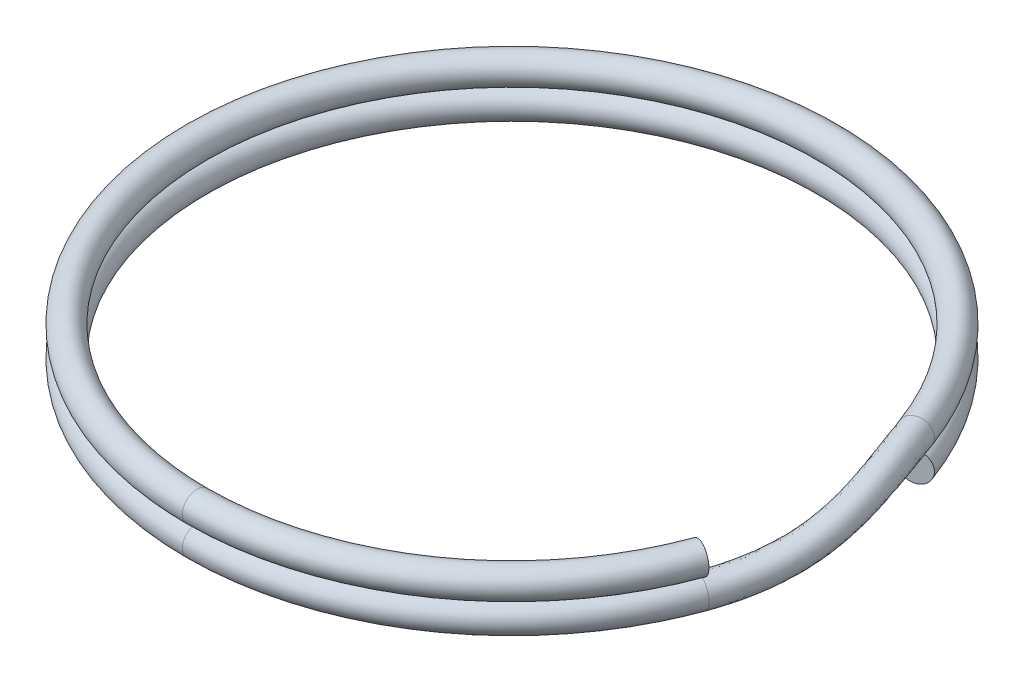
ISO-10303-21;
HEADER;
FILE_DESCRIPTION(('STEP AP214'),'2;1');
FILE_NAME('part.step','',(''),(''),'','','');
FILE_SCHEMA(('AUTOMOTIVE_DESIGN { 1 0 10303 214 1 1 1 1 }'));
ENDSEC;
DATA;
#1=APPLICATION_CONTEXT('core data for automotive mechanical design processes');
#2=APPLICATION_PROTOCOL_DEFINITION('international standard','automotive_design',2000,#1);
#3=PRODUCT_CONTEXT('',#1,'mechanical');
#4=PRODUCT('Part','Part','',(#3));
#5=PRODUCT_RELATED_PRODUCT_CATEGORY('part','',(#4));
#6=PRODUCT_DEFINITION_FORMATION('','',#4);
#7=PRODUCT_DEFINITION_CONTEXT('part definition',#1,'design');
#8=PRODUCT_DEFINITION('design','',#6,#7);
#9=PRODUCT_DEFINITION_SHAPE('','',#8);
#10=(LENGTH_UNIT() NAMED_UNIT(*) SI_UNIT(.MILLI.,.METRE.));
#11=(NAMED_UNIT(*) PLANE_ANGLE_UNIT() SI_UNIT($,.RADIAN.));
#12=(NAMED_UNIT(*) SI_UNIT($,.STERADIAN.) SOLID_ANGLE_UNIT());
#13=UNCERTAINTY_MEASURE_WITH_UNIT(LENGTH_MEASURE(1.E-05),#10,'distance_accuracy_value','');
#14=(GEOMETRIC_REPRESENTATION_CONTEXT(3) GLOBAL_UNCERTAINTY_ASSIGNED_CONTEXT((#13)) GLOBAL_UNIT_ASSIGNED_CONTEXT((#10,
#11,#12)) REPRESENTATION_CONTEXT('',''));
#15=CARTESIAN_POINT('',(0.,0.,0.));
#16=DIRECTION('',(0.,0.,1.));
#17=DIRECTION('',(1.,0.,0.));
#18=AXIS2_PLACEMENT_3D('',#15,#16,#17);
#19=CARTESIAN_POINT('',(0.,0.,0.));
#20=DIRECTION('',(0.,1.,0.));
#21=DIRECTION('',(0.,0.,1.));
#22=AXIS2_PLACEMENT_3D('',#19,#20,#21);
#23=TOROIDAL_SURFACE('',#22,12.5,0.574999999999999);
#24=CARTESIAN_POINT('',(0.,0.,12.5));
#25=DIRECTION('',(1.,0.,0.));
#26=DIRECTION('',(0.,0.,-1.));
#27=AXIS2_PLACEMENT_3D('',#24,#25,#26);
#28=CIRCLE('',#27,0.574999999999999);
#29=CARTESIAN_POINT('',(0.,0.,13.075));
#30=VERTEX_POINT('',#29);
#31=EDGE_CURVE('E10',#30,#30,#28,.T.);
#32=ORIENTED_EDGE('',*,*,#31,.T.);
#33=EDGE_LOOP('',(#32));
#34=FACE_BOUND('',#33,.T.);
#35=CARTESIAN_POINT('',(11.7461577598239,0.,4.27525179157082));
#36=DIRECTION('',(0.342020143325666,0.,-0.939692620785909));
#37=DIRECTION('',(-0.93969262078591,0.,-0.342020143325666));
#38=AXIS2_PLACEMENT_3D('',#35,#36,#37);
#39=CIRCLE('',#38,0.574999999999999);
#40=CARTESIAN_POINT('',(12.2610746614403,-0.174245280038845,4.46266621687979));
#41=VERTEX_POINT('',#40);
#42=EDGE_CURVE('E60',#41,#41,#39,.F.);
#43=ORIENTED_EDGE('',*,*,#42,.T.);
#44=EDGE_LOOP('',(#43));
#45=FACE_BOUND('',#44,.T.);
#46=ADVANCED_FACE('F35',(#34,#45),#23,.T.);
#47=CARTESIAN_POINT('',(11.7461577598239,0.,-4.27525179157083));
#48=DIRECTION('',(0.342020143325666,0.,0.939692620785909));
#49=DIRECTION('',(0.939692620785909,0.,-0.342020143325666));
#50=AXIS2_PLACEMENT_3D('',#47,#48,#49);
#51=CIRCLE('',#50,0.574999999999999);
#52=CARTESIAN_POINT('',(12.2864810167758,0.,-4.47191337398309));
#53=VERTEX_POINT('',#52);
#54=EDGE_CURVE('E43',#53,#53,#51,.F.);
#55=CARTESIAN_POINT('',(0.,0.,0.));
#56=DIRECTION('',(0.,1.,0.));
#57=DIRECTION('',(0.,0.,1.));
#58=AXIS2_PLACEMENT_3D('',#55,#56,#57);
#59=CIRCLE('',#58,13.075);
#60=EDGE_CURVE('',#53,#30,#59,.T.);
#61=ORIENTED_EDGE('',*,*,#54,.T.);
#62=ORIENTED_EDGE('',*,*,#31,.F.);
#63=ORIENTED_EDGE('',*,*,#60,.T.);
#64=ORIENTED_EDGE('',*,*,#60,.F.);
#65=EDGE_LOOP('',(#61,#63,#62,#64));
#66=FACE_BOUND('',#65,.T.);
#67=ADVANCED_FACE('F128',(#66),#23,.T.);
#68=CARTESIAN_POINT('',(0.,-0.574999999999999,0.));
#69=DIRECTION('',(0.342020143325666,0.,0.939692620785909));
#70=DIRECTION('',(0.939692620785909,0.,-0.342020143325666));
#71=AXIS2_PLACEMENT_3D('',#68,#69,#70);
#72=PLANE('',#71);
#73=ORIENTED_EDGE('',*,*,#54,.F.);
#74=EDGE_LOOP('',(#73));
#75=FACE_BOUND('',#74,.T.);
#76=ADVANCED_FACE('F94',(#75),#72,.T.);
#77=CARTESIAN_POINT('',(12.2610746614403,-0.174245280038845,4.46266621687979));
#78=CARTESIAN_POINT('',(13.6020765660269,-0.174245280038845,0.778293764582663));
#79=CARTESIAN_POINT('',(13.6180421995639,1.27553558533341,-0.78410477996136));
#80=CARTESIAN_POINT('',(12.2770402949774,1.27553558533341,-4.46847723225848));
#81=CARTESIAN_POINT('',(12.2565562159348,-0.189366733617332,4.46102163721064));
#82=CARTESIAN_POINT('',(13.5974566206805,-0.189366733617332,0.776928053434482));
#83=CARTESIAN_POINT('',(13.6207158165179,1.25994527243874,-0.785393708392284));
#84=CARTESIAN_POINT('',(12.2798154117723,1.25994527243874,-4.46948729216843));
#85=CARTESIAN_POINT('',(12.2464506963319,-0.218934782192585,4.45734352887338));
#86=CARTESIAN_POINT('',(13.5870108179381,-0.218934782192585,0.774184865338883));
#87=CARTESIAN_POINT('',(13.6246841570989,1.22881817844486,-0.787896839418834));
#88=CARTESIAN_POINT('',(12.2841240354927,1.22881817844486,-4.47105550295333));
#89=CARTESIAN_POINT('',(12.2282617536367,-0.261165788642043,4.45072329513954));
#90=CARTESIAN_POINT('',(13.567925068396,-0.261165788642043,0.770028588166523));
#91=CARTESIAN_POINT('',(13.6266365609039,1.18246162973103,-0.791397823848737));
#92=CARTESIAN_POINT('',(12.2869732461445,1.18246162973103,-4.47209253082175));
#93=CARTESIAN_POINT('',(12.2072173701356,-0.301179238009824,4.44306376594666));
#94=CARTESIAN_POINT('',(13.5456074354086,-0.301179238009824,0.765867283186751));
#95=CARTESIAN_POINT('',(13.6247099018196,1.13661267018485,-0.794658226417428));
#96=CARTESIAN_POINT('',(12.2863198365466,1.13661267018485,-4.47185470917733));
#97=CARTESIAN_POINT('',(12.0648697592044,-0.527375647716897,4.39125347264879));
#98=CARTESIAN_POINT('',(13.3935687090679,-0.527375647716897,0.740683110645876));
#99=CARTESIAN_POINT('',(13.5907492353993,0.865605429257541,-0.812450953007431));
#100=CARTESIAN_POINT('',(12.2620502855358,0.865605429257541,-4.46302131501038));
#101=CARTESIAN_POINT('',(11.8097730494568,-0.624897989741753,4.29840586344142));
#102=CARTESIAN_POINT('',(13.1105299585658,-0.624897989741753,0.724605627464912));
#103=CARTESIAN_POINT('',(13.381879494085,0.65081655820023,-0.823368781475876));
#104=CARTESIAN_POINT('',(12.081122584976,0.65081655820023,-4.39716901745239));
#105=CARTESIAN_POINT('',(11.2982303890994,-0.451794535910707,4.11221956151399));
#106=CARTESIAN_POINT('',(12.5431131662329,-0.451794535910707,0.691932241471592));
#107=CARTESIAN_POINT('',(12.7986016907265,0.544500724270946,-0.784922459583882));
#108=CARTESIAN_POINT('',(11.553718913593,0.544500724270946,-4.20520977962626));
#109=CARTESIAN_POINT('',(11.1408719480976,-0.128183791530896,4.05494577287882));
#110=CARTESIAN_POINT('',(12.3570032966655,-0.128183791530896,0.713652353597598));
#111=CARTESIAN_POINT('',(12.4869089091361,0.749695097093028,-0.760934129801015));
#112=CARTESIAN_POINT('',(11.2707775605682,0.749695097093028,-4.10222754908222));
#113=CARTESIAN_POINT('',(11.3216097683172,0.476674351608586,4.12072895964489));
#114=CARTESIAN_POINT('',(12.5414123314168,0.476674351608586,0.769348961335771));
#115=CARTESIAN_POINT('',(12.3795754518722,1.37330761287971,-0.710445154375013));
#116=CARTESIAN_POINT('',(11.1597728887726,1.37330761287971,-4.06182515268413));
#117=CARTESIAN_POINT('',(11.6257043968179,0.644131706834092,4.2314103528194));
#118=CARTESIAN_POINT('',(12.8779296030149,0.644131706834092,0.790949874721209));
#119=CARTESIAN_POINT('',(12.6048177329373,1.67440751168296,-0.69154528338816));
#120=CARTESIAN_POINT('',(11.3525925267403,1.67440751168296,-4.13200576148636));
#121=CARTESIAN_POINT('',(12.1372470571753,0.471028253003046,4.41759665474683));
#122=CARTESIAN_POINT('',(13.4455063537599,0.471028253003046,0.823183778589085));
#123=CARTESIAN_POINT('',(13.1882554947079,1.78072334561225,-0.729552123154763));
#124=CARTESIAN_POINT('',(11.8799961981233,1.78072334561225,-4.3239649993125));
#125=CARTESIAN_POINT('',(12.2925631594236,0.234624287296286,4.47412709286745));
#126=CARTESIAN_POINT('',(13.6264040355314,0.234624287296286,0.809429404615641));
#127=CARTESIAN_POINT('',(13.4560475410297,1.65123211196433,-0.747424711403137));
#128=CARTESIAN_POINT('',(12.1222066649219,1.65123211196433,-4.41212239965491));
#129=CARTESIAN_POINT('',(12.2860010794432,-0.0375212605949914,4.47173869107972));
#130=CARTESIAN_POINT('',(13.6261708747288,-0.0375212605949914,0.789652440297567));
#131=CARTESIAN_POINT('',(13.5781026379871,1.40844568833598,-0.77215703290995));
#132=CARTESIAN_POINT('',(12.2379328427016,1.40844568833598,-4.45424328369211));
#133=CARTESIAN_POINT('',(12.2814635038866,-0.0831205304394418,4.47008714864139));
#134=CARTESIAN_POINT('',(13.6223283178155,-0.0831205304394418,0.786091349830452));
#135=CARTESIAN_POINT('',(13.5951628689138,1.366027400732,-0.776203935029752));
#136=CARTESIAN_POINT('',(12.2542980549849,1.366027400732,-4.46019973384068));
#137=CARTESIAN_POINT('',(12.2733913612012,-0.128775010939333,4.46714912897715));
#138=CARTESIAN_POINT('',(13.6145604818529,-0.128775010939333,0.782317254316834));
#139=CARTESIAN_POINT('',(13.6087468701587,1.32177346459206,-0.780201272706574));
#140=CARTESIAN_POINT('',(12.2675777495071,1.32177346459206,-4.4650331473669));
#141=CARTESIAN_POINT('',(12.2655931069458,-0.159123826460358,4.46431079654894));
#142=CARTESIAN_POINT('',(13.6066965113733,-0.159123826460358,0.779659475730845));
#143=CARTESIAN_POINT('',(13.6153685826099,1.29112589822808,-0.782815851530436));
#144=CARTESIAN_POINT('',(12.2742651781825,1.29112589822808,-4.46746717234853));
#145=CARTESIAN_POINT('',(12.2610746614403,-0.174245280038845,4.46266621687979));
#146=CARTESIAN_POINT('',(13.6020765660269,-0.174245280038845,0.778293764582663));
#147=CARTESIAN_POINT('',(13.6180421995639,1.27553558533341,-0.78410477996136));
#148=CARTESIAN_POINT('',(12.2770402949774,1.27553558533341,-4.46847723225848));
#149=B_SPLINE_SURFACE_WITH_KNOTS('',3,3,((#77,#78,#79,#80),(#81,#82,#83,#84),(#85,#86,#87,#88),
(#89,#90,#91,#92),(#93,#94,#95,#96),(#97,#98,#99,#100),(#101,#102,#103,#104),(#105,#106,#107,
#108),(#109,#110,#111,#112),(#113,#114,#115,#116),(#117,#118,#119,#120),(#121,#122,#123,#124),
(#125,#126,#127,#128),(#129,#130,#131,#132),(#133,#134,#135,#136),(#137,#138,#139,#140),(#141,
#142,#143,#144),(#145,#146,#147,#148)),.UNSPECIFIED.,.T.,.F.,.F.,(4,1,1,1,1,2,2,2,1,1,1,1,4),(4,
4),(0.,0.0125,0.0249999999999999,0.0375000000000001,0.05,0.25,0.5,0.75,0.95,0.9625,0.975,0.9875,
1.),(0.,1.),.UNSPECIFIED.);
#150=CARTESIAN_POINT('',(11.7461577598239,1.16851847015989,-4.27525179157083));
#151=DIRECTION('',(0.342020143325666,0.,0.939692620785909));
#152=DIRECTION('',(0.939692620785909,0.,-0.342020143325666));
#153=AXIS2_PLACEMENT_3D('',#150,#151,#152);
#154=CIRCLE('',#153,0.574999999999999);
#155=CARTESIAN_POINT('',(12.2770402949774,1.27553558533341,-4.46847723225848));
#156=VERTEX_POINT('',#155);
#157=EDGE_CURVE('E48',#156,#156,#154,.F.);
#158=CARTESIAN_POINT('',(12.2610746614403,-0.174245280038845,4.46266621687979));
#159=CARTESIAN_POINT('',(12.2636906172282,-0.174245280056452,4.45547893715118));
#160=CARTESIAN_POINT('',(12.2663047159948,-0.174239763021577,4.44829098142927));
#161=CARTESIAN_POINT('',(12.271522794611,-0.174217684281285,4.43393119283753));
#162=CARTESIAN_POINT('',(12.274126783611,-0.17420114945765,4.42675936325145));
#163=CARTESIAN_POINT('',(12.2793246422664,-0.17415707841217,4.4124317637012));
#164=CARTESIAN_POINT('',(12.2819185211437,-0.174129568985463,4.40527599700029));
#165=CARTESIAN_POINT('',(12.2870961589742,-0.174063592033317,4.39098046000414));
#166=CARTESIAN_POINT('',(12.2896799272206,-0.174025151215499,4.38384069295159));
#167=CARTESIAN_POINT('',(12.294837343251,-0.173937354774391,4.36957709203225));
#168=CARTESIAN_POINT('',(12.297411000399,-0.173888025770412,4.36245326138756));
#169=CARTESIAN_POINT('',(12.3025481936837,-0.173778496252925,4.34822147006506));
#170=CARTESIAN_POINT('',(12.305111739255,-0.173718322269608,4.34111351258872));
#171=CARTESIAN_POINT('',(12.3102287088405,-0.173587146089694,4.3269134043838));
#172=CARTESIAN_POINT('',(12.3127821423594,-0.173516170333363,4.31982125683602));
#173=CARTESIAN_POINT('',(12.3178788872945,-0.173363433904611,4.30565270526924));
#174=CARTESIAN_POINT('',(12.3204222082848,-0.173281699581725,4.29857630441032));
#175=CARTESIAN_POINT('',(12.3254987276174,-0.173107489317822,4.28443918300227));
#176=CARTESIAN_POINT('',(12.3280319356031,-0.173015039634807,4.27737846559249));
#177=CARTESIAN_POINT('',(12.3330882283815,-0.172819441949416,4.26327264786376));
#178=CARTESIAN_POINT('',(12.3356113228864,-0.172716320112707,4.25622755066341));
#179=CARTESIAN_POINT('',(12.3406473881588,-0.172499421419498,4.24215291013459));
#180=CARTESIAN_POINT('',(12.3431603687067,-0.172385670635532,4.23512336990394));
#181=CARTESIAN_POINT('',(12.3481762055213,-0.172147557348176,4.22107978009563));
#182=CARTESIAN_POINT('',(12.3506790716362,-0.172023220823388,4.21406573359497));
#183=CARTESIAN_POINT('',(12.3556746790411,-0.171763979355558,4.20005306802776));
#184=CARTESIAN_POINT('',(12.3581674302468,-0.171629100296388,4.19305445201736));
#185=CARTESIAN_POINT('',(12.3631428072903,-0.171348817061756,4.17907258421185));
#186=CARTESIAN_POINT('',(12.3656254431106,-0.171203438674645,4.17208933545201));
#187=CARTESIAN_POINT('',(12.3705805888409,-0.170902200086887,4.15813813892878));
#188=CARTESIAN_POINT('',(12.3730531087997,-0.170746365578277,4.15117019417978));
#189=CARTESIAN_POINT('',(12.377988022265,-0.17042425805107,4.13724954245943));
#190=CARTESIAN_POINT('',(12.3804504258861,-0.170258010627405,4.13029683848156));
#191=CARTESIAN_POINT('',(12.3853651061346,-0.169915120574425,4.11640660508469));
#192=CARTESIAN_POINT('',(12.3878173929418,-0.169738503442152,4.10946907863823));
#193=CARTESIAN_POINT('',(12.3927118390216,-0.169374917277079,4.09560913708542));
#194=CARTESIAN_POINT('',(12.3951540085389,-0.169187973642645,4.08868672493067));
#195=CARTESIAN_POINT('',(12.4000282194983,-0.16880377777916,4.07485694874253));
#196=CARTESIAN_POINT('',(12.4024602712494,-0.168606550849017,4.06794958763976));
#197=CARTESIAN_POINT('',(12.4073142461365,-0.168201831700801,4.05414985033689));
#198=CARTESIAN_POINT('',(12.4097361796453,-0.1679943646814,4.0472574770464));
#199=CARTESIAN_POINT('',(12.4145699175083,-0.167569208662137,4.03348765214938));
#200=CARTESIAN_POINT('',(12.4169817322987,-0.167351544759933,4.02661020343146));
#201=CARTESIAN_POINT('',(12.4217952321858,-0.166906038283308,4.0128701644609));
#202=CARTESIAN_POINT('',(12.4241969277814,-0.166678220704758,4.00600757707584));
#203=CARTESIAN_POINT('',(12.4289901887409,-0.166212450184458,3.99229719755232));
#204=CARTESIAN_POINT('',(12.4313817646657,-0.16597452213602,3.98544940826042));
#205=CARTESIAN_POINT('',(12.4361547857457,-0.165488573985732,3.97176856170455));
#206=CARTESIAN_POINT('',(12.4385362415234,-0.165240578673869,3.9649355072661));
#207=CARTESIAN_POINT('',(12.4432890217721,-0.164734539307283,3.95128406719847));
#208=CARTESIAN_POINT('',(12.4456603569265,-0.164476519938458,3.94446568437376));
#209=CARTESIAN_POINT('',(12.4503928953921,-0.163950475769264,3.93084352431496));
#210=CARTESIAN_POINT('',(12.4527541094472,-0.163682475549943,3.9240397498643));
#211=CARTESIAN_POINT('',(12.4574664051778,-0.163136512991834,3.91044674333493));
#212=CARTESIAN_POINT('',(12.4598174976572,-0.162858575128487,3.9036575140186));
#213=CARTESIAN_POINT('',(12.4645095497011,-0.162292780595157,3.89009353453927));
#214=CARTESIAN_POINT('',(12.4668505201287,-0.162004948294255,3.88331878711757));
#215=CARTESIAN_POINT('',(12.4715223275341,-0.161419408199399,3.86978370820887));
#216=CARTESIAN_POINT('',(12.4738531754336,-0.161121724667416,3.8630233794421));
#217=CARTESIAN_POINT('',(12.4785047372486,-0.160516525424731,3.84951707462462));
#218=CARTESIAN_POINT('',(12.4808254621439,-0.160209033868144,3.84277110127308));
#219=CARTESIAN_POINT('',(12.4854567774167,-0.159584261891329,3.82929344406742));
#220=CARTESIAN_POINT('',(12.4877673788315,-0.159267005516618,3.82256176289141));
#221=CARTESIAN_POINT('',(12.4923784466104,-0.158622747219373,3.80911262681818));
#222=CARTESIAN_POINT('',(12.4946789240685,-0.15829576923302,3.80239517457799));
#223=CARTESIAN_POINT('',(12.4992697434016,-0.157632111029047,3.78897443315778));
#224=CARTESIAN_POINT('',(12.5015600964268,-0.157295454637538,3.78227114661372));
#225=CARTESIAN_POINT('',(12.5061306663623,-0.156612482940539,3.76887867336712));
#226=CARTESIAN_POINT('',(12.5084108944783,-0.156266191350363,3.7621894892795));
#227=CARTESIAN_POINT('',(12.5129612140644,-0.155563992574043,3.74882515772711));
#228=CARTESIAN_POINT('',(12.515231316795,-0.155208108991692,3.74215001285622));
#229=CARTESIAN_POINT('',(12.5197613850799,-0.154486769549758,3.72881369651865));
#230=CARTESIAN_POINT('',(12.5220213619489,-0.154121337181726,3.7221525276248));
#231=CARTESIAN_POINT('',(12.5265311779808,-0.153380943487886,3.70884410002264));
#232=CARTESIAN_POINT('',(12.528781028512,-0.153006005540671,3.70219684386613));
#233=CARTESIAN_POINT('',(12.533270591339,-0.152246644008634,3.68891617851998));
#234=CARTESIAN_POINT('',(12.535510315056,-0.151862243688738,3.68228277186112));
#235=CARTESIAN_POINT('',(12.5399796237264,-0.151084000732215,3.66902974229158));
#236=CARTESIAN_POINT('',(12.5422092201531,-0.150690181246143,3.66241012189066));
#237=CARTESIAN_POINT('',(12.546658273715,-0.149893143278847,3.64918460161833));
#238=CARTESIAN_POINT('',(12.5488777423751,-0.149489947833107,3.64257870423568));
#239=CARTESIAN_POINT('',(12.5533065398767,-0.148674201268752,3.62938056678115));
#240=CARTESIAN_POINT('',(12.5555158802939,-0.148261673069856,3.62278832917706));
#241=CARTESIAN_POINT('',(12.5599244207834,-0.147427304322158,3.60961744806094));
#242=CARTESIAN_POINT('',(12.5621236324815,-0.14700548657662,3.60303880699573));
#243=CARTESIAN_POINT('',(12.5665119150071,-0.146152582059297,3.5898950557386));
#244=CARTESIAN_POINT('',(12.5687009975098,-0.145721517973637,3.58332994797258));
#245=CARTESIAN_POINT('',(12.5730690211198,-0.144850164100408,3.57021320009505));
#246=CARTESIAN_POINT('',(12.5752479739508,-0.144409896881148,3.56366156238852));
#247=CARTESIAN_POINT('',(12.5795957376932,-0.143520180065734,3.55057169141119));
#248=CARTESIAN_POINT('',(12.5817645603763,-0.143070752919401,3.54403346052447));
#249=CARTESIAN_POINT('',(12.5860920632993,-0.142162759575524,3.53097033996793));
#250=CARTESIAN_POINT('',(12.5882507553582,-0.141704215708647,3.52444545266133));
#251=CARTESIAN_POINT('',(12.5925579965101,-0.140778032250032,3.51140895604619));
#252=CARTESIAN_POINT('',(12.5947065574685,-0.140310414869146,3.50489734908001));
#253=CARTESIAN_POINT('',(12.5989935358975,-0.139366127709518,3.49188734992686));
#254=CARTESIAN_POINT('',(12.6011319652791,-0.138889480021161,3.48538896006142));
#255=CARTESIAN_POINT('',(12.6053986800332,-0.137927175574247,3.47240533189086));
#256=CARTESIAN_POINT('',(12.6075269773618,-0.137441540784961,3.46592009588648));
#257=CARTESIAN_POINT('',(12.6117734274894,-0.136461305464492,3.4529627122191));
#258=CARTESIAN_POINT('',(12.6138915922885,-0.135966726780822,3.4464905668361));
#259=CARTESIAN_POINT('',(12.6181177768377,-0.134968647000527,3.4335593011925));
#260=CARTESIAN_POINT('',(12.6202258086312,-0.134465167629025,3.42710018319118));
#261=CARTESIAN_POINT('',(12.6244317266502,-0.133449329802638,3.41419490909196));
#262=CARTESIAN_POINT('',(12.6265296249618,-0.132936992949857,3.40774875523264));
#263=CARTESIAN_POINT('',(12.6307152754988,-0.131903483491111,3.3948693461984));
#264=CARTESIAN_POINT('',(12.6328030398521,-0.131382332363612,3.3884360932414));
#265=CARTESIAN_POINT('',(12.6369684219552,-0.130331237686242,3.37558242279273));
#266=CARTESIAN_POINT('',(12.6390460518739,-0.129801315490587,3.36916200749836));
#267=CARTESIAN_POINT('',(12.6431911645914,-0.128732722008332,3.35633394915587));
#268=CARTESIAN_POINT('',(12.6452586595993,-0.128194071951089,3.34992630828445));
#269=CARTESIAN_POINT('',(12.6493835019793,-0.127108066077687,3.33712373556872));
#270=CARTESIAN_POINT('',(12.6514408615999,-0.126560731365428,3.33072880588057));
#271=CARTESIAN_POINT('',(12.6555454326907,-0.125457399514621,3.3179515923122));
#272=CARTESIAN_POINT('',(12.6575926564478,-0.124901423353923,3.31156931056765));
#273=CARTESIAN_POINT('',(12.6616769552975,-0.123780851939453,3.29881732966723));
#274=CARTESIAN_POINT('',(12.6637140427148,-0.123216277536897,3.29244763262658));
#275=CARTESIAN_POINT('',(12.6677780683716,-0.122078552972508,3.27972075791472));
#276=CARTESIAN_POINT('',(12.6698050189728,-0.121505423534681,3.27336358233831));
#277=CARTESIAN_POINT('',(12.6738487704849,-0.120350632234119,3.26066168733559));
#278=CARTESIAN_POINT('',(12.6758655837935,-0.119768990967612,3.25431696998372));
#279=CARTESIAN_POINT('',(12.6798890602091,-0.118597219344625,3.24163992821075));
#280=CARTESIAN_POINT('',(12.6818957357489,-0.118007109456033,3.23530760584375));
#281=CARTESIAN_POINT('',(12.6858989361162,-0.116818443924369,3.22265529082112));
#282=CARTESIAN_POINT('',(12.6878954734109,-0.116219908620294,3.21633530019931));
#283=CARTESIAN_POINT('',(12.691878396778,-0.115014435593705,3.20370758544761));
#284=CARTESIAN_POINT('',(12.6938647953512,-0.114407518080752,3.19739986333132));
#285=CARTESIAN_POINT('',(12.6978274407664,-0.113185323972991,3.18479662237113));
#286=CARTESIAN_POINT('',(12.6998037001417,-0.112570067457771,3.17850110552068));
#287=CARTESIAN_POINT('',(12.7037460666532,-0.111331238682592,3.16592221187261));
#288=CARTESIAN_POINT('',(12.7057121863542,-0.11070768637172,3.15963883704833));
#289=CARTESIAN_POINT('',(12.7096342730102,-0.109452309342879,3.14708416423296));
#290=CARTESIAN_POINT('',(12.7115902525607,-0.108820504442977,3.14081286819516));
#291=CARTESIAN_POINT('',(12.7154920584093,-0.107548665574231,3.1282822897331));
#292=CARTESIAN_POINT('',(12.7174378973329,-0.106908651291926,3.12202300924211));
#293=CARTESIAN_POINT('',(12.7213194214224,-0.105620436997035,3.10951639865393));
#294=CARTESIAN_POINT('',(12.7232551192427,-0.104972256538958,3.10326907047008));
#295=CARTESIAN_POINT('',(12.7271163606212,-0.103667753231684,3.09078630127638));
#296=CARTESIAN_POINT('',(12.7290419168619,-0.103011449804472,3.08455086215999));
#297=CARTESIAN_POINT('',(12.7328828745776,-0.101690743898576,3.07209180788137));
#298=CARTESIAN_POINT('',(12.7347982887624,-0.101026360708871,3.06586819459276));
#299=CARTESIAN_POINT('',(12.7386189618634,-0.0996895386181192,3.0534327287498));
#300=CARTESIAN_POINT('',(12.7405242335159,-0.0990171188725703,3.04722087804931));
#301=CARTESIAN_POINT('',(12.7443246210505,-0.0976642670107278,3.0348088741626));
#302=CARTESIAN_POINT('',(12.7462197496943,-0.0969838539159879,3.02860872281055));
#303=CARTESIAN_POINT('',(12.7499998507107,-0.0956150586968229,3.01622005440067));
#304=CARTESIAN_POINT('',(12.7518848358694,-0.0949266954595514,3.01003153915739));
#305=CARTESIAN_POINT('',(12.7556446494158,-0.0935420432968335,2.99766607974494));
#306=CARTESIAN_POINT('',(12.757519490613,-0.0928457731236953,2.99148913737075));
#307=CARTESIAN_POINT('',(12.7612590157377,-0.0914453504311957,2.97914676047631));
#308=CARTESIAN_POINT('',(12.763123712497,-0.0907412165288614,2.97298132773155));
#309=CARTESIAN_POINT('',(12.766842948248,-0.0893251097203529,2.96066190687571));
#310=CARTESIAN_POINT('',(12.7686975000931,-0.0886131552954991,2.9545079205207));
#311=CARTESIAN_POINT('',(12.7723964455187,-0.0871814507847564,2.94221132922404));
#312=CARTESIAN_POINT('',(12.7742408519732,-0.0864617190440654,2.93606872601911));
#313=CARTESIAN_POINT('',(12.7779195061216,-0.0850145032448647,2.92379483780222));
#314=CARTESIAN_POINT('',(12.7797537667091,-0.0842870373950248,2.9176635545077));
#315=CARTESIAN_POINT('',(12.7834121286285,-0.0828243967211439,2.90541224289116));
#316=CARTESIAN_POINT('',(12.7852362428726,-0.0820892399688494,2.89929221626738));
#317=CARTESIAN_POINT('',(12.7888743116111,-0.0806112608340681,2.88706335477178));
#318=CARTESIAN_POINT('',(12.7906882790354,-0.0798684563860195,2.88095452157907));
#319=CARTESIAN_POINT('',(12.7943060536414,-0.0783752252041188,2.86874798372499));
#320=CARTESIAN_POINT('',(12.7961098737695,-0.0776248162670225,2.86265028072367));
#321=CARTESIAN_POINT('',(12.799707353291,-0.0761164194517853,2.85046594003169));
#322=CARTESIAN_POINT('',(12.8015010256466,-0.0753584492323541,2.84437930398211));
#323=CARTESIAN_POINT('',(12.8050782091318,-0.0738349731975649,2.8322170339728));
#324=CARTESIAN_POINT('',(12.8068617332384,-0.0730694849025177,2.82614140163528));
#325=CARTESIAN_POINT('',(12.8104186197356,-0.0715310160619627,2.81400107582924));
#326=CARTESIAN_POINT('',(12.8121919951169,-0.0707580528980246,2.8079363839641));
#327=CARTESIAN_POINT('',(12.8157285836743,-0.0692046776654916,2.7958178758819));
#328=CARTESIAN_POINT('',(12.8174918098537,-0.0684242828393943,2.78976406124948));
#329=CARTESIAN_POINT('',(12.8210080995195,-0.0668560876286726,2.7776672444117));
#330=CARTESIAN_POINT('',(12.8227611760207,-0.066068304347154,2.77162424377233));
#331=CARTESIAN_POINT('',(12.8262571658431,-0.0644853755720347,2.75954899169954));
#332=CARTESIAN_POINT('',(12.8280000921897,-0.0636902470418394,2.75351674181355));
#333=CARTESIAN_POINT('',(12.8314757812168,-0.062092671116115,2.74146292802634));
#334=CARTESIAN_POINT('',(12.8332085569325,-0.0612902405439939,2.73544136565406));
#335=CARTESIAN_POINT('',(12.8366639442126,-0.0596781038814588,2.72340886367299));
#336=CARTESIAN_POINT('',(12.8383865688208,-0.0588684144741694,2.71739792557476));
#337=CARTESIAN_POINT('',(12.8418216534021,-0.0572418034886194,2.70538660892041));
#338=CARTESIAN_POINT('',(12.8435341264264,-0.0564248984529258,2.69938623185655));
#339=CARTESIAN_POINT('',(12.8469489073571,-0.0547838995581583,2.6873959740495));
#340=CARTESIAN_POINT('',(12.8486512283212,-0.0539598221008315,2.68140609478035));
#341=CARTESIAN_POINT('',(12.8520457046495,-0.0523045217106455,2.66943676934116));
#342=CARTESIAN_POINT('',(12.8537378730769,-0.051473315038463,2.66345732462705));
#343=CARTESIAN_POINT('',(12.857112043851,-0.0498037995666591,2.65150880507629));
#344=CARTESIAN_POINT('',(12.8587940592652,-0.0489655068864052,2.64553973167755));
#345=CARTESIAN_POINT('',(12.8621479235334,-0.0472818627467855,2.6336118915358));
#346=CARTESIAN_POINT('',(12.8638197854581,-0.0464365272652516,2.62765312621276));
#347=CARTESIAN_POINT('',(12.8671533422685,-0.0447388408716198,2.61574583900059));
#348=CARTESIAN_POINT('',(12.8688150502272,-0.0438865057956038,2.60979731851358));
#349=CARTESIAN_POINT('',(12.872128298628,-0.0421748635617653,2.59791045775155));
#350=CARTESIAN_POINT('',(12.8737798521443,-0.0413155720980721,2.59197211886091));
#351=CARTESIAN_POINT('',(12.8770727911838,-0.0395900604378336,2.58010555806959));
#352=CARTESIAN_POINT('',(12.8787141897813,-0.0387238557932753,2.57417733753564));
#353=CARTESIAN_POINT('',(12.8819868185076,-0.036984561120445,2.56233095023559));
#354=CARTESIAN_POINT('',(12.8836180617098,-0.0361114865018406,2.55641278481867));
#355=CARTESIAN_POINT('',(12.8868703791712,-0.0343584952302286,2.54458644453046));
#356=CARTESIAN_POINT('',(12.8884914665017,-0.033478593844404,2.53867827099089));
#357=CARTESIAN_POINT('',(12.8917234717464,-0.0317119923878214,2.52687185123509));
#358=CARTESIAN_POINT('',(12.8933344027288,-0.03082530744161,2.52097360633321));
#359=CARTESIAN_POINT('',(12.896546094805,-0.0290451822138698,2.50918698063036));
#360=CARTESIAN_POINT('',(12.8981468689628,-0.0281517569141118,2.50329860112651));
#361=CARTESIAN_POINT('',(12.9013382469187,-0.0263581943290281,2.49153164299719));
#362=CARTESIAN_POINT('',(12.9029288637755,-0.025458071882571,2.48565306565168));
#363=CARTESIAN_POINT('',(12.9060999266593,-0.0236511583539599,2.47390564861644));
#364=CARTESIAN_POINT('',(12.9076803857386,-0.0227443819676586,2.46803681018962));
#365=CARTESIAN_POINT('',(12.9108311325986,-0.0209242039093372,2.45630880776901));
#366=CARTESIAN_POINT('',(12.912401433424,-0.0200108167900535,2.45044964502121));
#367=CARTESIAN_POINT('',(12.9155318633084,-0.0181774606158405,2.43874093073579));
#368=CARTESIAN_POINT('',(12.9170920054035,-0.017257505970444,2.43289138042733));
#369=CARTESIAN_POINT('',(12.9202021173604,-0.0154110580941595,2.42120182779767));
#370=CARTESIAN_POINT('',(12.9217521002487,-0.014484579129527,2.41536182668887));
#371=CARTESIAN_POINT('',(12.9248418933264,-0.0126251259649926,2.40369130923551));
#372=CARTESIAN_POINT('',(12.9263817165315,-0.0116921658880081,2.39786079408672));
#373=CARTESIAN_POINT('',(12.9294511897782,-0.00981979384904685,2.38620918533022));
#374=CARTESIAN_POINT('',(12.9309808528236,-0.00888039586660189,2.38038809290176));
#375=CARTESIAN_POINT('',(12.9340300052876,-0.00699519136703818,2.36875526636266));
#376=CARTESIAN_POINT('',(12.9355495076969,-0.00604939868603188,2.36294353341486));
#377=CARTESIAN_POINT('',(12.9385783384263,-0.00415144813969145,2.35132936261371));
#378=CARTESIAN_POINT('',(12.940087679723,-0.00319930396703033,2.34552692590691));
#379=CARTESIAN_POINT('',(12.9430961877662,-0.00128869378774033,2.33393128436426));
#380=CARTESIAN_POINT('',(12.9445953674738,-0.00033024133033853,2.32813808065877));
#381=CARTESIAN_POINT('',(12.9475835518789,0.00159294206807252,2.31656084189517));
#382=CARTESIAN_POINT('',(12.9490725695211,0.00255765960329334,2.31077680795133));
#383=CARTESIAN_POINT('',(12.9520404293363,0.0044933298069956,2.29921784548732));
#384=CARTESIAN_POINT('',(12.9535192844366,0.00546426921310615,2.29344291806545));
#385=CARTESIAN_POINT('',(12.9564668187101,0.00741233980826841,2.28190210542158));
#386=CARTESIAN_POINT('',(12.957935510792,0.00838945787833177,2.27613622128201));
#387=CARTESIAN_POINT('',(12.9608627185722,0.0103498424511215,2.26461343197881));
#388=CARTESIAN_POINT('',(12.9623212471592,0.0113330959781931,2.25885652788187));
#389=CARTESIAN_POINT('',(12.9652281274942,0.0133057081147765,2.24735163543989));
#390=CARTESIAN_POINT('',(12.96667649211,0.0142950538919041,2.24160364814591));
#391=CARTESIAN_POINT('',(12.969563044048,0.0162798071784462,2.23011652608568));
#392=CARTESIAN_POINT('',(12.9710012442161,0.0172752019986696,2.22437739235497));
#393=CARTESIAN_POINT('',(12.9738674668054,0.0192720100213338,2.21290791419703));
#394=CARTESIAN_POINT('',(12.9752955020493,0.0202734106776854,2.20717757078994));
#395=CARTESIAN_POINT('',(12.9781413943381,0.0222821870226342,2.19572561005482));
#396=CARTESIAN_POINT('',(12.9795592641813,0.0232895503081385,2.19000399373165));
#397=CARTESIAN_POINT('',(12.9823848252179,0.025310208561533,2.17856942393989));
#398=CARTESIAN_POINT('',(12.983792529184,0.0263234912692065,2.17285647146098));
#399=CARTESIAN_POINT('',(12.9865977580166,0.0283559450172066,2.16143916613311));
#400=CARTESIAN_POINT('',(12.9879952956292,0.0293751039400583,2.15573481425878));
#401=CARTESIAN_POINT('',(12.990780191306,0.0314192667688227,2.14433464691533));
#402=CARTESIAN_POINT('',(12.9921675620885,0.0324442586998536,2.1386388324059));
#403=CARTESIAN_POINT('',(12.9949321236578,0.0345000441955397,2.12725567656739));
#404=CARTESIAN_POINT('',(12.9963093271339,0.0355308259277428,2.12156833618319));
#405=CARTESIAN_POINT('',(12.9990535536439,0.037598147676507,2.11020206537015));
#406=CARTESIAN_POINT('',(13.000420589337,0.0386346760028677,2.1045231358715));
#407=CARTESIAN_POINT('',(13.0031444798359,0.0407134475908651,2.09317362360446));
#408=CARTESIAN_POINT('',(13.0045013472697,0.0417556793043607,2.08750304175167));
#409=CARTESIAN_POINT('',(13.0072049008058,0.0438458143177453,2.07617016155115));
#410=CARTESIAN_POINT('',(13.0085515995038,0.0448937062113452,2.07050786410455));
#411=CARTESIAN_POINT('',(13.0112348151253,0.0469951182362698,2.05919148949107));
#412=CARTESIAN_POINT('',(13.012571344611,0.0480486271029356,2.05353741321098));
#413=CARTESIAN_POINT('',(13.0152342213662,0.0501612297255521,2.04223741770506));
#414=CARTESIAN_POINT('',(13.0165605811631,0.0512203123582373,2.0365914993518));
#415=CARTESIAN_POINT('',(13.0192031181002,0.0533440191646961,2.02530775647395));
#416=CARTESIAN_POINT('',(13.020519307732,0.0544086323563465,2.01966993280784));
#417=CARTESIAN_POINT('',(13.0231415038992,0.0565433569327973,2.00840231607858));
#418=CARTESIAN_POINT('',(13.0244475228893,0.0576134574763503,2.00277252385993));
#419=CARTESIAN_POINT('',(13.027049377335,0.0597591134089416,1.99152090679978));
#420=CARTESIAN_POINT('',(13.028345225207,0.0608346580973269,1.98589908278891));
#421=CARTESIAN_POINT('',(13.0309267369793,0.0629911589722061,1.97466333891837));
#422=CARTESIAN_POINT('',(13.0322124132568,0.0640721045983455,1.96904941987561));
#423=CARTESIAN_POINT('',(13.034773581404,0.0662393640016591,1.95782942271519));
#424=CARTESIAN_POINT('',(13.0360490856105,0.0673256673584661,1.95222334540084));
#425=CARTESIAN_POINT('',(13.0385899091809,0.0695035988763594,1.94101896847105));
#426=CARTESIAN_POINT('',(13.0398552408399,0.0705952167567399,1.93542066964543));
#427=CARTESIAN_POINT('',(13.0423757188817,0.0727837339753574,1.92423178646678));
#428=CARTESIAN_POINT('',(13.0436308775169,0.0738806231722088,1.9186412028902));
#429=CARTESIAN_POINT('',(13.0461310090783,0.0760796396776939,1.90746768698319));
#430=CARTESIAN_POINT('',(13.0473759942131,0.077181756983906,1.90188475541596));
#431=CARTESIAN_POINT('',(13.0498557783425,0.0793911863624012,1.8907264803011));
#432=CARTESIAN_POINT('',(13.0510905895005,0.0804984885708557,1.88515113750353));
#433=CARTESIAN_POINT('',(13.053550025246,0.0827182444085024,1.87400797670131));
#434=CARTESIAN_POINT('',(13.0547746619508,0.0838306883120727,1.86844015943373));
#435=CARTESIAN_POINT('',(13.0572137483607,0.0860606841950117,1.85731198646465));
#436=CARTESIAN_POINT('',(13.0584282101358,0.0871782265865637,1.85175163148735));
#437=CARTESIAN_POINT('',(13.0608469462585,0.0894183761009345,1.8406383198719));
#438=CARTESIAN_POINT('',(13.0620512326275,0.0905409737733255,1.83508536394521));
#439=CARTESIAN_POINT('',(13.064449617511,0.092791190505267,1.82398678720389));
#440=CARTESIAN_POINT('',(13.0656437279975,0.0939188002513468,1.81844116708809));
#441=CARTESIAN_POINT('',(13.0680217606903,0.096178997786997,1.8073571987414));
#442=CARTESIAN_POINT('',(13.0692056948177,0.097311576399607,1.80181885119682));
#443=CARTESIAN_POINT('',(13.0715633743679,0.0995816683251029,1.79074936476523));
#444=CARTESIAN_POINT('',(13.0727371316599,0.100719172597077,1.78521822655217));
#445=CARTESIAN_POINT('',(13.0750744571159,0.102999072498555,1.77416309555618));
#446=CARTESIAN_POINT('',(13.076238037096,0.104141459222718,1.76863910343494));
#447=CARTESIAN_POINT('',(13.078555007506,0.106431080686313,1.75759820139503));
#448=CARTESIAN_POINT('',(13.0797084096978,0.107578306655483,1.75208129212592));
#449=CARTESIAN_POINT('',(13.08200502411,0.109877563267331,1.74105449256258));
#450=CARTESIAN_POINT('',(13.0831482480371,0.111029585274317,1.7355446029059));
#451=CARTESIAN_POINT('',(13.0854245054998,0.113338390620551,1.72453177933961));
#452=CARTESIAN_POINT('',(13.0865575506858,0.114495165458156,1.71902884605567));
#453=CARTESIAN_POINT('',(13.0888134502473,0.116813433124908,1.70802987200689));
#454=CARTESIAN_POINT('',(13.0899363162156,0.117974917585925,1.70253383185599));
#455=CARTESIAN_POINT('',(13.0921718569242,0.120302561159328,1.69154858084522));
#456=CARTESIAN_POINT('',(13.0932845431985,0.121468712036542,1.68605937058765));
#457=CARTESIAN_POINT('',(13.0954997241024,0.123805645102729,1.67508771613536));
#458=CARTESIAN_POINT('',(13.0966022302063,0.124976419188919,1.66960527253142));
#459=CARTESIAN_POINT('',(13.0987970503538,0.127322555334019,1.65864708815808));
#460=CARTESIAN_POINT('',(13.0998893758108,0.128497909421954,1.65317134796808));
#461=CARTESIAN_POINT('',(13.1020638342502,0.130853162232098,1.64222650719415));
#462=CARTESIAN_POINT('',(13.1031459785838,0.132033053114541,1.63675740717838));
#463=CARTESIAN_POINT('',(13.1053000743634,0.134397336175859,1.62582578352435));
#464=CARTESIAN_POINT('',(13.1063720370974,0.135581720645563,1.6203632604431));
#465=CARTESIAN_POINT('',(13.1085057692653,0.137954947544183,1.60944472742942));
#466=CARTESIAN_POINT('',(13.1095675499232,0.139143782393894,1.60398871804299));
#467=CARTESIAN_POINT('',(13.1116809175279,0.141525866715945,1.59308314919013));
#468=CARTESIAN_POINT('',(13.1127325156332,0.142719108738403,1.58763359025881));
#469=CARTESIAN_POINT('',(13.1148255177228,0.145109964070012,1.57674085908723));
#470=CARTESIAN_POINT('',(13.1158669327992,0.146307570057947,1.57129768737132));
#471=CARTESIAN_POINT('',(13.1179395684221,0.148707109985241,1.56041766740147));
#472=CARTESIAN_POINT('',(13.1189707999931,0.149909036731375,1.55498081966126));
#473=CARTESIAN_POINT('',(13.1210230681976,0.152317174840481,1.54411338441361));
#474=CARTESIAN_POINT('',(13.1220441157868,0.15352337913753,1.53868279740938));
#475=CARTESIAN_POINT('',(13.1240760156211,0.155940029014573,1.52782782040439));
#476=CARTESIAN_POINT('',(13.1250868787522,0.157150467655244,1.52240343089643));
#477=CARTESIAN_POINT('',(13.1270984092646,0.15957554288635,1.51156078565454));
#478=CARTESIAN_POINT('',(13.1280990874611,0.160790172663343,1.50614253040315));
#479=CARTESIAN_POINT('',(13.1300902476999,0.163223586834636,1.49531209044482));
#480=CARTESIAN_POINT('',(13.1310807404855,0.164442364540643,1.48989990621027));
#481=CARTESIAN_POINT('',(13.1330515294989,0.166884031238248,1.47908154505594));
#482=CARTESIAN_POINT('',(13.1340318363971,0.168106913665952,1.47367536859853));
#483=CARTESIAN_POINT('',(13.1359822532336,0.170556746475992,1.46286895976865));
#484=CARTESIAN_POINT('',(13.136952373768,0.171783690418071,1.45746872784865));
#485=CARTESIAN_POINT('',(13.1388824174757,0.17424160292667,1.44667414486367));
#486=CARTESIAN_POINT('',(13.1398423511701,0.175472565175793,1.44127979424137));
#487=CARTESIAN_POINT('',(13.1417520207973,0.177938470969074,1.43049691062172));
#488=CARTESIAN_POINT('',(13.1427017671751,0.179173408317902,1.4251083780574));
#489=CARTESIAN_POINT('',(13.1445910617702,0.181647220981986,1.41433706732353));
#490=CARTESIAN_POINT('',(13.1455306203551,0.182886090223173,1.40895428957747));
#491=CARTESIAN_POINT('',(13.1473995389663,0.185367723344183,1.39819442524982));
#492=CARTESIAN_POINT('',(13.148328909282,0.186610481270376,1.3928173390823));
#493=CARTESIAN_POINT('',(13.1501774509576,0.189099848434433,1.38206879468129));
#494=CARTESIAN_POINT('',(13.1510966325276,0.190346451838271,1.37669733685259));
#495=CARTESIAN_POINT('',(13.1529247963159,0.192843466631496,1.36595998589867));
#496=CARTESIAN_POINT('',(13.1538337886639,0.194093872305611,1.36059409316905));
#497=CARTESIAN_POINT('',(13.1556415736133,0.196598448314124,1.34986780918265));
#498=CARTESIAN_POINT('',(13.1565403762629,0.19785261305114,1.34450741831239));
#499=CARTESIAN_POINT('',(13.1583277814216,0.200364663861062,1.33379207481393));
#500=CARTESIAN_POINT('',(13.1592163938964,0.201622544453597,1.32843712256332));
#501=CARTESIAN_POINT('',(13.1609834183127,0.204141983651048,1.31773259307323));
#502=CARTESIAN_POINT('',(13.1618618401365,0.205403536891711,1.31238301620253));
#503=CARTESIAN_POINT('',(13.1636084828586,0.20793027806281,1.30168917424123));
#504=CARTESIAN_POINT('',(13.164476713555,0.209195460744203,1.29634490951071));
#505=CARTESIAN_POINT('',(13.1662029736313,0.211729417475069,1.28566162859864));
#506=CARTESIAN_POINT('',(13.1670610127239,0.212998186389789,1.28032261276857));
#507=CARTESIAN_POINT('',(13.1687668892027,0.215539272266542,1.26964976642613));
#508=CARTESIAN_POINT('',(13.1696147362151,0.216811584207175,1.26431593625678));
#509=CARTESIAN_POINT('',(13.1713002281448,0.219359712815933,1.25365339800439));
#510=CARTESIAN_POINT('',(13.1721378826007,0.220635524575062,1.24832469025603));
#511=CARTESIAN_POINT('',(13.1738029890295,0.223190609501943,1.23767233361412));
#512=CARTESIAN_POINT('',(13.1746304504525,0.224469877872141,1.23234868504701));
#513=CARTESIAN_POINT('',(13.1762751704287,0.227031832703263,1.22170638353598));
#514=CARTESIAN_POINT('',(13.1770924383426,0.228314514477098,1.21638773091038));
#515=CARTESIAN_POINT('',(13.1787167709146,0.23088325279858,1.20575535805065));
#516=CARTESIAN_POINT('',(13.179523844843,0.232169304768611,1.20044163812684));
#517=CARTESIAN_POINT('',(13.1811277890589,0.234744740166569,1.18981906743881));
#518=CARTESIAN_POINT('',(13.1819246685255,0.236034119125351,1.18451021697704));
#519=CARTESIAN_POINT('',(13.1835082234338,0.238616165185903,1.17389732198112));
#520=CARTESIAN_POINT('',(13.1842949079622,0.239908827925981,1.16859327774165));
#521=CARTESIAN_POINT('',(13.1858580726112,0.242497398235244,1.15798993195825));
#522=CARTESIAN_POINT('',(13.1866345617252,0.243793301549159,1.15269063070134));
#523=CARTESIAN_POINT('',(13.1881773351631,0.246388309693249,1.14209670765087));
#524=CARTESIAN_POINT('',(13.1889436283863,0.247687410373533,1.13680208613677));
#525=CARTESIAN_POINT('',(13.1904660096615,0.250288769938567,1.12621745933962));
#526=CARTESIAN_POINT('',(13.1912221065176,0.251591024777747,1.1209274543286));
#527=CARTESIAN_POINT('',(13.1927240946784,0.254198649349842,1.11035199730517));
#528=CARTESIAN_POINT('',(13.1934699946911,0.255504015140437,1.10506654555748));
#529=CARTESIAN_POINT('',(13.1949515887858,0.258117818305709,1.09450013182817));
#530=CARTESIAN_POINT('',(13.1956872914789,0.259426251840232,1.08921917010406));
#531=CARTESIAN_POINT('',(13.1971484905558,0.262046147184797,1.07866167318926));
#532=CARTESIAN_POINT('',(13.1978739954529,0.263357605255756,1.07338513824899));
#533=CARTESIAN_POINT('',(13.1993147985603,0.26598350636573,1.0628364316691));
#534=CARTESIAN_POINT('',(13.2000301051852,0.267297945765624,1.05756426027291));
#535=CARTESIAN_POINT('',(13.2014505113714,0.269929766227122,1.04702421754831));
#536=CARTESIAN_POINT('',(13.2021556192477,0.271247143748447,1.04175634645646));
#537=CARTESIAN_POINT('',(13.2035556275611,0.273884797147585,1.03122484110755));
#538=CARTESIAN_POINT('',(13.2042505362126,0.275205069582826,1.02596120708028));
#539=CARTESIAN_POINT('',(13.2056301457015,0.27784846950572,1.01543811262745));
#540=CARTESIAN_POINT('',(13.206314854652,0.27917159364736,1.01017865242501));
#541=CARTESIAN_POINT('',(13.2076740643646,0.281820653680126,0.999663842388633));
#542=CARTESIAN_POINT('',(13.2083485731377,0.283146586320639,0.994408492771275));
#543=CARTESIAN_POINT('',(13.2096873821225,0.285801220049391,0.983901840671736));
#544=CARTESIAN_POINT('',(13.210351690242,0.287129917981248,0.978650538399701));
#545=CARTESIAN_POINT('',(13.2116700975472,0.289790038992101,0.968151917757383));
#546=CARTESIAN_POINT('',(13.2123242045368,0.291121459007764,0.962904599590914));
#547=CARTESIAN_POINT('',(13.2136222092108,0.293786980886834,0.952413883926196));
#548=CARTESIAN_POINT('',(13.2142661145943,0.295121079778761,0.947170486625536));
#549=CARTESIAN_POINT('',(13.2155437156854,0.297791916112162,0.936687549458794));
#550=CARTESIAN_POINT('',(13.2161774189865,0.299128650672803,0.931448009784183));
#551=CARTESIAN_POINT('',(13.217434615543,0.301804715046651,0.920972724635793));
#552=CARTESIAN_POINT('',(13.2180581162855,0.303144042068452,0.915736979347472));
#553=CARTESIAN_POINT('',(13.2192949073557,0.305825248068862,0.905269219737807));
#554=CARTESIAN_POINT('',(13.2199082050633,0.307167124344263,0.900037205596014));
#555=CARTESIAN_POINT('',(13.2211245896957,0.309853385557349,0.889576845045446));
#556=CARTESIAN_POINT('',(13.2217276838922,0.311197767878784,0.884348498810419));
#557=CARTESIAN_POINT('',(13.2229236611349,0.313888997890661,0.873895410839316));
#558=CARTESIAN_POINT('',(13.2235165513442,0.315235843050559,0.868670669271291));
#559=CARTESIAN_POINT('',(13.2246921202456,0.317931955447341,0.858224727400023));
#560=CARTESIAN_POINT('',(13.2252748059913,0.319281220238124,0.853003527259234));
#561=CARTESIAN_POINT('',(13.2264299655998,0.321982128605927,0.842564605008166));
#562=CARTESIAN_POINT('',(13.2270024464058,0.323333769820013,0.837346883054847));
#563=CARTESIAN_POINT('',(13.2281371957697,0.326039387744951,0.826914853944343));
#564=CARTESIAN_POINT('',(13.2286994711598,0.327393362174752,0.821700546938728));
#565=CARTESIAN_POINT('',(13.2298138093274,0.330103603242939,0.811275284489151));
#566=CARTESIAN_POINT('',(13.2303658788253,0.331459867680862,0.80606432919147));
#567=CARTESIAN_POINT('',(13.2314598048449,0.334174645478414,0.795645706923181));
#568=CARTESIAN_POINT('',(13.2320016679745,0.33553315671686,0.790438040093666));
#569=CARTESIAN_POINT('',(13.2330751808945,0.338252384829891,0.780025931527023));
#570=CARTESIAN_POINT('',(13.2336068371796,0.339613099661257,0.774821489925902));
#571=CARTESIAN_POINT('',(13.2346599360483,0.342336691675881,0.764415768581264));
#572=CARTESIAN_POINT('',(13.2351813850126,0.343699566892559,0.759214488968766));
#573=CARTESIAN_POINT('',(13.2362140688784,0.34642743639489,0.748815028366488));
#574=CARTESIAN_POINT('',(13.2367253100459,0.347792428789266,0.74361684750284));
#575=CARTESIAN_POINT('',(13.237737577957,0.35052448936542,0.733223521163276));
#576=CARTESIAN_POINT('',(13.2382386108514,0.351891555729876,0.728028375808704));
#577=CARTESIAN_POINT('',(13.2392304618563,0.354627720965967,0.717641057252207));
#578=CARTESIAN_POINT('',(13.2397212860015,0.355996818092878,0.712448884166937));
#579=CARTESIAN_POINT('',(13.2406927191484,0.358737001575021,0.702067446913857));
#580=CARTESIAN_POINT('',(13.2411733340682,0.360108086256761,0.696878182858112));
#581=CARTESIAN_POINT('',(13.2421243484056,0.36285220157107,0.686502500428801));
#582=CARTESIAN_POINT('',(13.2425947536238,0.364225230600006,0.681316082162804));
#583=CARTESIAN_POINT('',(13.2435253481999,0.366973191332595,0.670946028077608));
#584=CARTESIAN_POINT('',(13.2439855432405,0.36834812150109,0.665762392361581));
#585=CARTESIAN_POINT('',(13.2448957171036,0.371099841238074,0.655397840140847));
#586=CARTESIAN_POINT('',(13.2453457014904,0.372476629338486,0.650216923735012));
#587=CARTESIAN_POINT('',(13.2462354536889,0.375232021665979,0.639857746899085));
#588=CARTESIAN_POINT('',(13.2466752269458,0.376610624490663,0.634679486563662));
#589=CARTESIAN_POINT('',(13.2475445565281,0.379369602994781,0.624325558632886));
#590=CARTESIAN_POINT('',(13.2479741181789,0.380749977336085,0.619149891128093));
#591=CARTESIAN_POINT('',(13.2488230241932,0.383512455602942,0.608801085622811));
#592=CARTESIAN_POINT('',(13.2492423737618,0.384894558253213,0.603627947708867));
#593=CARTESIAN_POINT('',(13.2500708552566,0.387660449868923,0.593284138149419));
#594=CARTESIAN_POINT('',(13.2504799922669,0.389044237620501,0.588113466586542));
#595=CARTESIAN_POINT('',(13.2512880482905,0.39181345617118,0.577774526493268));
#596=CARTESIAN_POINT('',(13.2516869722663,0.393198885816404,0.572606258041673));
#597=CARTESIAN_POINT('',(13.252474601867,0.395971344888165,0.562272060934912));
#598=CARTESIAN_POINT('',(13.2528633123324,0.397358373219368,0.557106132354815));
#599=CARTESIAN_POINT('',(13.2536305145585,0.400133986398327,0.546776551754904));
#600=CARTESIAN_POINT('',(13.2540090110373,0.401522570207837,0.541612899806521));
#601=CARTESIAN_POINT('',(13.2547557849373,0.404301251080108,0.531287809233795));
#602=CARTESIAN_POINT('',(13.2551240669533,0.405691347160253,0.526126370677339));
#603=CARTESIAN_POINT('',(13.2558504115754,0.408473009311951,0.515805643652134));
#604=CARTESIAN_POINT('',(13.2562084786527,0.409864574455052,0.510646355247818));
#605=CARTESIAN_POINT('',(13.2569143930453,0.412649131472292,0.500329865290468));
#606=CARTESIAN_POINT('',(13.2572622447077,0.414042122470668,0.495172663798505));
#607=CARTESIAN_POINT('',(13.2579477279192,0.416829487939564,0.484860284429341));
#608=CARTESIAN_POINT('',(13.2582853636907,0.418223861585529,0.479705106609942));
#609=CARTESIAN_POINT('',(13.2589504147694,0.421013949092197,0.469396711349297));
#610=CARTESIAN_POINT('',(13.2592778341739,0.422409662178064,0.464243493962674));
#611=CARTESIAN_POINT('',(13.2599224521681,0.425202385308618,0.453938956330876));
#612=CARTESIAN_POINT('',(13.2602396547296,0.426599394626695,0.448787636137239));
#613=CARTESIAN_POINT('',(13.2608638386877,0.42939466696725,0.43848682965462));
#614=CARTESIAN_POINT('',(13.2611708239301,0.430792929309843,0.433337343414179));
#615=CARTESIAN_POINT('',(13.2617745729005,0.433590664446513,0.423040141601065));
#616=CARTESIAN_POINT('',(13.2620713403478,0.434990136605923,0.417892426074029));
#617=CARTESIAN_POINT('',(13.2626546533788,0.437790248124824,0.407598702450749));
#618=CARTESIAN_POINT('',(13.2629412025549,0.439190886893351,0.402452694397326));
#619=CARTESIAN_POINT('',(13.2635040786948,0.441993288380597,0.392162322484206));
#620=CARTESIAN_POINT('',(13.2637804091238,0.443395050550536,0.387017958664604));
#621=CARTESIAN_POINT('',(13.264322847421,0.446199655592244,0.37673081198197));
#622=CARTESIAN_POINT('',(13.2645889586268,0.447602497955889,0.371588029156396));
#623=CARTESIAN_POINT('',(13.2651109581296,0.450409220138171,0.361303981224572));
#624=CARTESIAN_POINT('',(13.2653668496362,0.451813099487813,0.356162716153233));
#625=CARTESIAN_POINT('',(13.265868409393,0.454621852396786,0.345881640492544));
#626=CARTESIAN_POINT('',(13.2661140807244,0.456026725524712,0.340741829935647));
#627=CARTESIAN_POINT('',(13.2665951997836,0.45883742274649,0.330463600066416));
#628=CARTESIAN_POINT('',(13.2668306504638,0.460243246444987,0.325325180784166));
#629=CARTESIAN_POINT('',(13.2672913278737,0.463055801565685,0.315049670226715));
#630=CARTESIAN_POINT('',(13.2675165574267,0.464462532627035,0.309912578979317));
#631=CARTESIAN_POINT('',(13.2679567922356,0.467276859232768,0.299639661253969));
#632=CARTESIAN_POINT('',(13.2681718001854,0.468684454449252,0.294503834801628));
#633=CARTESIAN_POINT('',(13.2685915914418,0.471500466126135,0.284233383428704));
#634=CARTESIAN_POINT('',(13.2687963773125,0.472908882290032,0.279098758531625));
#635=CARTESIAN_POINT('',(13.2691957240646,0.475726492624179,0.268830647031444));
#636=CARTESIAN_POINT('',(13.2693902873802,0.477135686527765,0.263697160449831));
#637=CARTESIAN_POINT('',(13.2697691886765,0.479954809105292,0.253431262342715));
#638=CARTESIAN_POINT('',(13.2699535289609,0.481364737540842,0.248298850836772));
#639=CARTESIAN_POINT('',(13.2703119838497,0.484185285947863,0.238035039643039));
#640=CARTESIAN_POINT('',(13.2704861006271,0.485595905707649,0.232903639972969));
#641=CARTESIAN_POINT('',(13.2708241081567,0.488417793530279,0.22264178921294));
#642=CARTESIAN_POINT('',(13.2709880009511,0.489829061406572,0.217511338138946));
#643=CARTESIAN_POINT('',(13.27130556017,0.492652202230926,0.207251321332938));
#644=CARTESIAN_POINT('',(13.2714592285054,0.494064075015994,0.202121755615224));
#645=CARTESIAN_POINT('',(13.2717563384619,0.496888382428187,0.191863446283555));
#646=CARTESIAN_POINT('',(13.2718997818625,0.498300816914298,0.186734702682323));
#647=CARTESIAN_POINT('',(13.2721764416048,0.501126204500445,0.176477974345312));
#648=CARTESIAN_POINT('',(13.2723096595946,0.502539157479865,0.171349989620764));
#649=CARTESIAN_POINT('',(13.2725658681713,0.505365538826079,0.161094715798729));
#650=CARTESIAN_POINT('',(13.2726888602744,0.506778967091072,0.155967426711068));
#651=CARTESIAN_POINT('',(13.2729246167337,0.509606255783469,0.145713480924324));
#652=CARTESIAN_POINT('',(13.2730373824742,0.511020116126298,0.140586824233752));
#653=CARTESIAN_POINT('',(13.2732526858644,0.513848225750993,0.130334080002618));
#654=CARTESIAN_POINT('',(13.2733552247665,0.51526247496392,0.125207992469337));
#655=CARTESIAN_POINT('',(13.2735500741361,0.518091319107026,0.114956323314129));
#656=CARTESIAN_POINT('',(13.2736423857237,0.519505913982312,0.109830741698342));
#657=CARTESIAN_POINT('',(13.273816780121,0.522335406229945,0.0995800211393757));
#658=CARTESIAN_POINT('',(13.2738988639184,0.52375030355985,0.0944548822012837));
#659=CARTESIAN_POINT('',(13.2740528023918,0.526580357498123,0.0842049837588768));
#660=CARTESIAN_POINT('',(13.2741246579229,0.527995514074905,0.0790802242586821));
#661=CARTESIAN_POINT('',(13.2742581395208,0.530826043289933,0.0688310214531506));
#662=CARTESIAN_POINT('',(13.2743197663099,0.53224141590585,0.063706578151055));
#663=CARTESIAN_POINT('',(13.2744327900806,0.535072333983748,0.0534579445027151));
#664=CARTESIAN_POINT('',(13.2744841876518,0.536487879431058,0.0483337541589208));
#665=CARTESIAN_POINT('',(13.2745767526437,0.539319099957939,0.038085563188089));
#666=CARTESIAN_POINT('',(13.2746179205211,0.540734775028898,0.0329615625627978));
#667=CARTESIAN_POINT('',(13.2746900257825,0.543566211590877,0.0227136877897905));
#668=CARTESIAN_POINT('',(13.2747209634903,0.544981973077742,0.0175898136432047));
#669=CARTESIAN_POINT('',(13.2747726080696,0.547813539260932,0.00734212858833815));
#670=CARTESIAN_POINT('',(13.2747933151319,0.549229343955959,0.0022183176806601));
#671=CARTESIAN_POINT('',(13.2748244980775,0.552060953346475,-0.00802930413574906));
#672=CARTESIAN_POINT('',(13.2748349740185,0.553476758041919,-0.0131531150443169));
#673=CARTESIAN_POINT('',(13.2748456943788,0.556308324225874,-0.0234008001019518));
#674=CARTESIAN_POINT('',(13.2748459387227,0.55772408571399,-0.0285246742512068));
#675=CARTESIAN_POINT('',(13.2748361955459,0.560555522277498,-0.0387725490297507));
#676=CARTESIAN_POINT('',(13.2748262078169,0.561971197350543,-0.04389654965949));
#677=CARTESIAN_POINT('',(13.2747960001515,0.564802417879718,-0.0541447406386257));
#678=CARTESIAN_POINT('',(13.2747757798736,0.566217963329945,-0.0592689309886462));
#679=CARTESIAN_POINT('',(13.274725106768,0.5690488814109,-0.0695175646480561));
#680=CARTESIAN_POINT('',(13.2746946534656,0.570464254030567,-0.0746420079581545));
#681=CARTESIAN_POINT('',(13.2746235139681,0.573294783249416,-0.0848912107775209));
#682=CARTESIAN_POINT('',(13.2745828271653,0.574709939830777,-0.0900159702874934));
#683=CARTESIAN_POINT('',(13.2744912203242,0.577539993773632,-0.100265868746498));
#684=CARTESIAN_POINT('',(13.2744402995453,0.578954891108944,-0.105391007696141));
#685=CARTESIAN_POINT('',(13.2743282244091,0.58178438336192,-0.115641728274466));
#686=CARTESIAN_POINT('',(13.2742670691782,0.583198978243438,-0.120767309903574));
#687=CARTESIAN_POINT('',(13.2741345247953,0.586027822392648,-0.1310189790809));
#688=CARTESIAN_POINT('',(13.2740631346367,0.58744207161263,-0.136145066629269));
#689=CARTESIAN_POINT('',(13.2739101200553,0.590270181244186,-0.146397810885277));
#690=CARTESIAN_POINT('',(13.2738284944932,0.59168404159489,-0.151524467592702));
#691=CARTESIAN_POINT('',(13.2736550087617,0.594511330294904,-0.16177841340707));
#692=CARTESIAN_POINT('',(13.2735631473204,0.595924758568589,-0.166905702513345));
#693=CARTESIAN_POINT('',(13.2733691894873,0.598751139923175,-0.177160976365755));
#694=CARTESIAN_POINT('',(13.273267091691,0.6001640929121,-0.182288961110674));
#695=CARTESIAN_POINT('',(13.2730526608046,0.602989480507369,-0.192545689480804));
#696=CARTESIAN_POINT('',(13.2729403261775,0.604401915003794,-0.197674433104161));
#697=CARTESIAN_POINT('',(13.2727054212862,0.60722622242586,-0.207932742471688));
#698=CARTESIAN_POINT('',(13.2725828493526,0.608638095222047,-0.213062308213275));
#699=CARTESIAN_POINT('',(13.2723274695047,0.611461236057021,-0.223322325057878));
#700=CARTESIAN_POINT('',(13.272194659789,0.612872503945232,-0.228452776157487));
#701=CARTESIAN_POINT('',(13.2719188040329,0.615694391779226,-0.238714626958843));
#702=CARTESIAN_POINT('',(13.2717757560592,0.617105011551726,-0.243846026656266));
#703=CARTESIAN_POINT('',(13.2714794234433,0.619925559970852,-0.25410983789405));
#704=CARTESIAN_POINT('',(13.2713261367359,0.621335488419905,-0.259242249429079));
#705=CARTESIAN_POINT('',(13.2710093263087,0.624154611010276,-0.269508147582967));
#706=CARTESIAN_POINT('',(13.2708458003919,0.625563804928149,-0.274641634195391));
#707=CARTESIAN_POINT('',(13.2705085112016,0.628381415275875,-0.284909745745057));
#708=CARTESIAN_POINT('',(13.2703347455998,0.629789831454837,-0.290044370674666));
#709=CARTESIAN_POINT('',(13.2699769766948,0.63260584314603,-0.300314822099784));
#710=CARTESIAN_POINT('',(13.2697929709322,0.63401343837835,-0.305450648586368));
#711=CARTESIAN_POINT('',(13.2694147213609,0.636827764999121,-0.315723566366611));
#712=CARTESIAN_POINT('',(13.2692204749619,0.638234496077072,-0.320860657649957));
#713=CARTESIAN_POINT('',(13.2688217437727,0.641047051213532,-0.331136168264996));
#714=CARTESIAN_POINT('',(13.2686172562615,0.642452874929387,-0.336274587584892));
#715=CARTESIAN_POINT('',(13.2681980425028,0.645263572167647,-0.346552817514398));
#716=CARTESIAN_POINT('',(13.2679833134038,0.646668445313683,-0.351692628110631));
#717=CARTESIAN_POINT('',(13.2675436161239,0.649477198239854,-0.361973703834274));
#718=CARTESIAN_POINT('',(13.2673186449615,0.650881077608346,-0.36711496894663));
#719=CARTESIAN_POINT('',(13.2668584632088,0.653687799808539,-0.377399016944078));
#720=CARTESIAN_POINT('',(13.2666232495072,0.65509064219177,-0.382541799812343));
#721=CARTESIAN_POINT('',(13.2661425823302,0.657895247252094,-0.392828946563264));
#722=CARTESIAN_POINT('',(13.2658971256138,0.659297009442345,-0.397973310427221));
#723=CARTESIAN_POINT('',(13.2653959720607,0.662099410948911,-0.408263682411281));
#724=CARTESIAN_POINT('',(13.265140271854,0.663500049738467,-0.413409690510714));
#725=CARTESIAN_POINT('',(13.2646186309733,0.666300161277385,-0.423703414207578));
#726=CARTESIAN_POINT('',(13.2643526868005,0.667699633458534,-0.42885112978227));
#727=CARTESIAN_POINT('',(13.2638105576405,0.670497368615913,-0.439148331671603));
#728=CARTESIAN_POINT('',(13.263534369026,0.671895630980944,-0.444297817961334));
#729=CARTESIAN_POINT('',(13.2629717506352,0.674690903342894,-0.454598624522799));
#730=CARTESIAN_POINT('',(13.2626853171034,0.676087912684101,-0.459749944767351));
#731=CARTESIAN_POINT('',(13.2621022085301,0.678880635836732,-0.470054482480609));
#732=CARTESIAN_POINT('',(13.2618055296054,0.680276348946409,-0.475207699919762));
#733=CARTESIAN_POINT('',(13.2612019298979,0.68306643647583,-0.485516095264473));
#734=CARTESIAN_POINT('',(13.2608950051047,0.684460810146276,-0.490671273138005));
#735=CARTESIAN_POINT('',(13.2602709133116,0.687248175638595,-0.500983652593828));
#736=CARTESIAN_POINT('',(13.2599537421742,0.688641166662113,-0.506140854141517));
#737=CARTESIAN_POINT('',(13.2593091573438,0.691425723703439,-0.51645734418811));
#738=CARTESIAN_POINT('',(13.2589817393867,0.692817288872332,-0.521616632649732));
#739=CARTESIAN_POINT('',(13.2583166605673,0.695598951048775,-0.531937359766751));
#740=CARTESIAN_POINT('',(13.2579789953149,0.69698904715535,-0.537098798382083));
#741=CARTESIAN_POINT('',(13.257293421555,0.699767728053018,-0.547423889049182));
#742=CARTESIAN_POINT('',(13.2569455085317,0.701156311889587,-0.552587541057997));
#743=CARTESIAN_POINT('',(13.2562394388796,0.703931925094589,-0.562917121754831));
#744=CARTESIAN_POINT('',(13.2558812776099,0.705318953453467,-0.568083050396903));
#745=CARTESIAN_POINT('',(13.255154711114,0.70809141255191,-0.578417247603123));
#746=CARTESIAN_POINT('',(13.2547863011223,0.709476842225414,-0.583585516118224));
#747=CARTESIAN_POINT('',(13.2540392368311,0.712246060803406,-0.593924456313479));
#748=CARTESIAN_POINT('',(13.2536605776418,0.713629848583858,-0.599095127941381));
#749=CARTESIAN_POINT('',(13.2528930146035,0.716395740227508,-0.609438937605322));
#750=CARTESIAN_POINT('',(13.2525041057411,0.717777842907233,-0.614612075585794));
#751=CARTESIAN_POINT('',(13.2517160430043,0.720540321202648,-0.624960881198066));
#752=CARTESIAN_POINT('',(13.2513168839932,0.721920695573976,-0.630136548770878));
#753=CARTESIAN_POINT('',(13.2505083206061,0.724679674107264,-0.640490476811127));
#754=CARTESIAN_POINT('',(13.2500989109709,0.726058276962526,-0.645668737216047));
#755=CARTESIAN_POINT('',(13.249269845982,0.728813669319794,-0.656027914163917));
#756=CARTESIAN_POINT('',(13.248850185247,0.730190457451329,-0.66120883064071));
#757=CARTESIAN_POINT('',(13.2480006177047,0.732942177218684,-0.671573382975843));
#758=CARTESIAN_POINT('',(13.2475707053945,0.734317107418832,-0.676757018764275));
#759=CARTESIAN_POINT('',(13.2467006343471,0.737065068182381,-0.687127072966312));
#760=CARTESIAN_POINT('',(13.2462604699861,0.738438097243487,-0.692313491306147));
#761=CARTESIAN_POINT('',(13.2453698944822,0.741182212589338,-0.702689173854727));
#762=CARTESIAN_POINT('',(13.2449194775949,0.742553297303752,-0.707878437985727));
#763=CARTESIAN_POINT('',(13.2440083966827,0.745293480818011,-0.718259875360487));
#764=CARTESIAN_POINT('',(13.2435477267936,0.746662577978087,-0.723452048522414));
#765=CARTESIAN_POINT('',(13.2426161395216,0.74939874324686,-0.733839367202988));
#766=CARTESIAN_POINT('',(13.2421452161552,0.750765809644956,-0.739034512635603));
#767=CARTESIAN_POINT('',(13.2411931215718,0.753497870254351,-0.749427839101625));
#768=CARTESIAN_POINT('',(13.2407119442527,0.754862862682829,-0.754626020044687));
#769=CARTESIAN_POINT('',(13.2397393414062,0.757590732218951,-0.765025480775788));
#770=CARTESIAN_POINT('',(13.2392479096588,0.75895360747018,-0.770226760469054));
#771=CARTESIAN_POINT('',(13.2382547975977,0.761677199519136,-0.780632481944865));
#772=CARTESIAN_POINT('',(13.2377531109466,0.763037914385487,-0.785836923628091));
#773=CARTESIAN_POINT('',(13.2367394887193,0.765757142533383,-0.796249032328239));
#774=CARTESIAN_POINT('',(13.236227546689,0.767115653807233,-0.80145669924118));
#775=CARTESIAN_POINT('',(13.2351934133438,0.769830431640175,-0.811875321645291));
#776=CARTESIAN_POINT('',(13.2346712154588,0.771186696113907,-0.817086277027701));
#777=CARTESIAN_POINT('',(13.2336165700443,0.773896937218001,-0.827511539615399));
#778=CARTESIAN_POINT('',(13.2330841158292,0.775250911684,-0.83272584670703));
#779=CARTESIAN_POINT('',(13.2320089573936,0.777956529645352,-0.843157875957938));
#780=CARTESIAN_POINT('',(13.2314662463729,0.779308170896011,-0.848375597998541));
#781=CARTESIAN_POINT('',(13.2303705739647,0.782009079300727,-0.858814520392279));
#782=CARTESIAN_POINT('',(13.229817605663,0.783358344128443,-0.864035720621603));
#783=CARTESIAN_POINT('',(13.2287014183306,0.786054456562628,-0.874481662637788));
#784=CARTESIAN_POINT('',(13.2281381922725,0.787401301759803,-0.879706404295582));
#785=CARTESIAN_POINT('',(13.2270014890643,0.790092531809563,-0.890159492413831));
#786=CARTESIAN_POINT('',(13.2264280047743,0.791436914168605,-0.895387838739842));
#787=CARTESIAN_POINT('',(13.2252707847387,0.794123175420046,-0.905848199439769));
#788=CARTESIAN_POINT('',(13.2246870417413,0.795465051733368,-0.911080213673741));
#789=CARTESIAN_POINT('',(13.2235093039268,0.798146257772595,-0.921547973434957));
#790=CARTESIAN_POINT('',(13.2229153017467,0.799485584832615,-0.926783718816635));
#791=CARTESIAN_POINT('',(13.2217170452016,0.802161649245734,-0.937259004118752));
#792=CARTESIAN_POINT('',(13.2211127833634,0.803498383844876,-0.942498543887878));
#793=CARTESIAN_POINT('',(13.2198940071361,0.806169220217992,-0.952981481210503));
#794=CARTESIAN_POINT('',(13.2192794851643,0.807503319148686,-0.958224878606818));
#795=CARTESIAN_POINT('',(13.2180401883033,0.810168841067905,-0.968715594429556));
#796=CARTESIAN_POINT('',(13.2174154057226,0.811500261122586,-0.973962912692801));
#797=CARTESIAN_POINT('',(13.2161555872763,0.814160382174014,-0.984461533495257));
#798=CARTESIAN_POINT('',(13.2155205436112,0.815489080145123,-0.989712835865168));
#799=CARTESIAN_POINT('',(13.2142402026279,0.818143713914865,-1.00021948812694));
#800=CARTESIAN_POINT('',(13.2135948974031,0.819469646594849,-1.00547483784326));
#801=CARTESIAN_POINT('',(13.2122940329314,0.82211870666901,-1.01598964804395));
#802=CARTESIAN_POINT('',(13.2116384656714,0.823441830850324,-1.02124910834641));
#803=CARTESIAN_POINT('',(13.2103170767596,0.82608523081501,-1.03177220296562));
#804=CARTESIAN_POINT('',(13.2096512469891,0.82740550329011,-1.03703583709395));
#805=CARTESIAN_POINT('',(13.2083093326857,0.830043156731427,-1.04756734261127));
#806=CARTESIAN_POINT('',(13.2076332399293,0.83136053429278,-1.0528352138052));
#807=CARTESIAN_POINT('',(13.2062707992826,0.833992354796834,-1.06337525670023));
#808=CARTESIAN_POINT('',(13.205584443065,0.835306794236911,-1.0686474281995));
#809=CARTESIAN_POINT('',(13.2042014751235,0.837932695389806,-1.07919613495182));
#810=CARTESIAN_POINT('',(13.2035048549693,0.839244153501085,-1.08447266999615));
#811=CARTESIAN_POINT('',(13.2021013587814,0.841864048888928,-1.09503016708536));
#812=CARTESIAN_POINT('',(13.2013944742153,0.843172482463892,-1.10031112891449));
#813=CARTESIAN_POINT('',(13.1999704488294,0.845786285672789,-1.11087754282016));
#814=CARTESIAN_POINT('',(13.1992532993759,0.847091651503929,-1.11616299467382));
#815=CARTESIAN_POINT('',(13.1978087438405,0.849699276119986,-1.12673845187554));
#816=CARTESIAN_POINT('',(13.1970813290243,0.851001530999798,-1.13202845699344));
#817=CARTESIAN_POINT('',(13.1956162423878,0.853602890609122,-1.14261308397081));
#818=CARTESIAN_POINT('',(13.1948785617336,0.854901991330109,-1.14790770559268));
#819=CARTESIAN_POINT('',(13.1933929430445,0.857496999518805,-1.15850162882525));
#820=CARTESIAN_POINT('',(13.1926449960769,0.858792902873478,-1.16380093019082));
#821=CARTESIAN_POINT('',(13.1911388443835,0.861381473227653,-1.17440427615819));
#822=CARTESIAN_POINT('',(13.1903806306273,0.862674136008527,-1.17970832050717));
#823=CARTESIAN_POINT('',(13.188853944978,0.865256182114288,-1.1903212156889));
#824=CARTESIAN_POINT('',(13.1880854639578,0.866545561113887,-1.19563006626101));
#825=CARTESIAN_POINT('',(13.1865382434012,0.869120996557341,-1.2062526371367));
#826=CARTESIAN_POINT('',(13.1857594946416,0.870407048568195,-1.21156635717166));
#827=CARTESIAN_POINT('',(13.184191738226,0.872975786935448,-1.22219873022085));
#828=CARTESIAN_POINT('',(13.1834027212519,0.874258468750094,-1.22751738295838));
#829=CARTESIAN_POINT('',(13.1818144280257,0.876820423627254,-1.23815968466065));
#830=CARTESIAN_POINT('',(13.1810151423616,0.878099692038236,-1.24348333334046));
#831=CARTESIAN_POINT('',(13.1794063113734,0.88065477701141,-1.25413569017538));
#832=CARTESIAN_POINT('',(13.178596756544,0.881930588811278,-1.25946439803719));
#833=CARTESIAN_POINT('',(13.1769673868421,0.884478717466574,-1.27012693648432));
#834=CARTESIAN_POINT('',(13.1761475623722,0.885751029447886,-1.27546076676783));
#835=CARTESIAN_POINT('',(13.1744976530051,0.888292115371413,-1.28613361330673));
#836=CARTESIAN_POINT('',(13.1736675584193,0.889560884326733,-1.29147262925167));
#837=CARTESIAN_POINT('',(13.1719971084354,0.892094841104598,-1.3021559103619));
#838=CARTESIAN_POINT('',(13.1711567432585,0.893360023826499,-1.30750017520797));
#839=CARTESIAN_POINT('',(13.1694657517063,0.895886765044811,-1.31819401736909));
#840=CARTESIAN_POINT('',(13.1686151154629,0.897148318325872,-1.32354359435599));
#841=CARTESIAN_POINT('',(13.1669035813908,0.89966775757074,-1.33424812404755));
#842=CARTESIAN_POINT('',(13.1660426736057,0.900925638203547,-1.339603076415));
#843=CARTESIAN_POINT('',(13.1643105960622,0.90343768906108,-1.35031842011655));
#844=CARTESIAN_POINT('',(13.1634394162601,0.904691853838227,-1.35567881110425));
#845=CARTESIAN_POINT('',(13.1616867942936,0.907196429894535,-1.36640509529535));
#846=CARTESIAN_POINT('',(13.1608053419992,0.908446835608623,-1.37177098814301));
#847=CARTESIAN_POINT('',(13.1590321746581,0.910943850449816,-1.38250833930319));
#848=CARTESIAN_POINT('',(13.1581404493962,0.912190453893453,-1.38787979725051));
#849=CARTESIAN_POINT('',(13.156346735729,0.91467982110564,-1.39862834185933));
#850=CARTESIAN_POINT('',(13.1554447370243,0.915922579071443,-1.404005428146));
#851=CARTESIAN_POINT('',(13.1536304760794,0.918404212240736,-1.41476529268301));
#852=CARTESIAN_POINT('',(13.1527182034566,0.919643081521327,-1.42014807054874));
#853=CARTESIAN_POINT('',(13.1508833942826,0.922116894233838,-1.43091938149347));
#854=CARTESIAN_POINT('',(13.1499608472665,0.923351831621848,-1.43630791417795));
#855=CARTESIAN_POINT('',(13.1481054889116,0.925817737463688,-1.44709079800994));
#856=CARTESIAN_POINT('',(13.1471726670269,0.927048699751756,-1.45248514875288));
#857=CARTESIAN_POINT('',(13.1452967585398,0.929506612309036,-1.46327973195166));
#858=CARTESIAN_POINT('',(13.1443536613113,0.930733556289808,-1.46867996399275));
#859=CARTESIAN_POINT('',(13.1424572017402,0.933183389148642,-1.47948637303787));
#860=CARTESIAN_POINT('',(13.1415038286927,0.934406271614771,-1.4848925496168));
#861=CARTESIAN_POINT('',(13.1395868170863,0.936847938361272,-1.49571091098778));
#862=CARTESIAN_POINT('',(13.1386231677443,0.93806671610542,-1.50112309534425));
#863=CARTESIAN_POINT('',(13.136685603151,0.940500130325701,-1.51195353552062));
#864=CARTESIAN_POINT('',(13.1357116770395,0.941714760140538,-1.51737179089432));
#865=CARTESIAN_POINT('',(13.1337535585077,0.944139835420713,-1.5282144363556));
#866=CARTESIAN_POINT('',(13.1327693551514,0.945350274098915,-1.53363882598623));
#867=CARTESIAN_POINT('',(13.1307906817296,0.947766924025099,-1.54449380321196));
#868=CARTESIAN_POINT('',(13.1297962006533,0.948973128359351,-1.54992439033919));
#869=CARTESIAN_POINT('',(13.1277969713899,0.95138126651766,-1.56079182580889));
#870=CARTESIAN_POINT('',(13.1267922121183,0.952583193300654,-1.56622867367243));
#871=CARTESIAN_POINT('',(13.1247724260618,0.954982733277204,-1.57710869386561));
#872=CARTESIAN_POINT('',(13.1237573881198,0.956180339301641,-1.58255186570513));
#873=CARTESIAN_POINT('',(13.1217170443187,0.958571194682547,-1.59344459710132));
#874=CARTESIAN_POINT('',(13.1206917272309,0.959764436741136,-1.59889415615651));
#875=CARTESIAN_POINT('',(13.1186308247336,0.962146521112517,-1.60979972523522));
#876=CARTESIAN_POINT('',(13.1175952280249,0.963335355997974,-1.61525573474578));
#877=CARTESIAN_POINT('',(13.11551376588,0.965708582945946,-1.62617426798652));
#878=CARTESIAN_POINT('',(13.1144678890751,0.966892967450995,-1.63163679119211));
#879=CARTESIAN_POINT('',(13.1123658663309,0.969257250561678,-1.6425684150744));
#880=CARTESIAN_POINT('',(13.1113097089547,0.970437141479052,-1.64803751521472));
#881=CARTESIAN_POINT('',(13.1091871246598,0.972792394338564,-1.65898235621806));
#882=CARTESIAN_POINT('',(13.108120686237,0.973967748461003,-1.66445809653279));
#883=CARTESIAN_POINT('',(13.1059775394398,0.976313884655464,-1.6754162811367));
#884=CARTESIAN_POINT('',(13.1049008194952,0.977484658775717,-1.68089872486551));
#885=CARTESIAN_POINT('',(13.1027371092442,0.979821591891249,-1.69187037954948));
#886=CARTESIAN_POINT('',(13.1016501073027,0.980987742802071,-1.69735958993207));
#887=CARTESIAN_POINT('',(13.0994658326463,0.983315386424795,-1.7083448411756));
#888=CARTESIAN_POINT('',(13.0983685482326,0.984476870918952,-1.71384088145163));
#889=CARTESIAN_POINT('',(13.0961637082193,0.986795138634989,-1.72483985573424));
#890=CARTESIAN_POINT('',(13.0950561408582,0.987951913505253,-1.73034278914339));
#891=CARTESIAN_POINT('',(13.0928307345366,0.990260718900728,-1.74135561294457));
#892=CARTESIAN_POINT('',(13.0917128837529,0.99141274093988,-1.74686550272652));
#893=CARTESIAN_POINT('',(13.0894669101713,0.993711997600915,-1.75789230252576));
#894=CARTESIAN_POINT('',(13.0883387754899,0.994859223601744,-1.76340921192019));
#895=CARTESIAN_POINT('',(13.0860722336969,0.997148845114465,-1.77445011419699));
#896=CARTESIAN_POINT('',(13.0849338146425,0.998291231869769,-1.77997410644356));
#897=CARTESIAN_POINT('',(13.0826467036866,1.0005711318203,-1.79102923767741));
#898=CARTESIAN_POINT('',(13.081497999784,1.00170863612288,-1.7965603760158));
#899=CARTESIAN_POINT('',(13.0791903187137,1.00397872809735,-1.8076298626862));
#900=CARTESIAN_POINT('',(13.0780313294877,1.00511130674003,-1.81316821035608));
#901=CARTESIAN_POINT('',(13.0757030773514,1.00737150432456,-1.82425217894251));
#902=CARTESIAN_POINT('',(13.0745338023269,1.00849911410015,-1.82979779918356));
#903=CARTESIAN_POINT('',(13.0721849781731,1.01074933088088,-1.8408963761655));
#904=CARTESIAN_POINT('',(13.0710054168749,1.01187192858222,-1.84644933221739));
#905=CARTESIAN_POINT('',(13.0686360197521,1.01411207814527,-1.85756264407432));
#906=CARTESIAN_POINT('',(13.067446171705,1.01522962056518,-1.86312299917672));
#907=CARTESIAN_POINT('',(13.0650562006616,1.01745961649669,-1.87425117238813));
#908=CARTESIAN_POINT('',(13.0638560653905,1.01857206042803,-1.8798189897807));
#909=CARTESIAN_POINT('',(13.0614455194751,1.02079181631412,-1.89096215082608));
#910=CARTESIAN_POINT('',(13.0602350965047,1.02189911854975,-1.89653749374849));
#911=CARTESIAN_POINT('',(13.0578039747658,1.02410854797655,-1.90769576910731));
#912=CARTESIAN_POINT('',(13.0565832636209,1.02521066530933,-1.91327870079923));
#913=CARTESIAN_POINT('',(13.0541315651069,1.02740968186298,-1.92445221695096));
#914=CARTESIAN_POINT('',(13.0529005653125,1.02850657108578,-1.93004280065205));
#915=CARTESIAN_POINT('',(13.050428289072,1.03069508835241,-1.94123168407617));
#916=CARTESIAN_POINT('',(13.0491870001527,1.03178670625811,-1.94682998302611));
#917=CARTESIAN_POINT('',(13.0466941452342,1.03396463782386,-1.95803436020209));
#918=CARTESIAN_POINT('',(13.045442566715,1.03505094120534,-1.96364043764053));
#919=CARTESIAN_POINT('',(13.0429291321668,1.03721820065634,-1.97486043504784));
#920=CARTESIAN_POINT('',(13.0416672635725,1.03829914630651,-1.98047435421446));
#921=CARTESIAN_POINT('',(13.0391332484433,1.0404556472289,-1.99171009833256));
#922=CARTESIAN_POINT('',(13.0378610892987,1.04153119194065,-1.99733192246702));
#923=CARTESIAN_POINT('',(13.035306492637,1.04367684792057,-2.00858353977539));
#924=CARTESIAN_POINT('',(13.0340240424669,1.04474694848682,-2.01421333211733));
#925=CARTESIAN_POINT('',(13.0314488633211,1.04688167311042,-2.02548094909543));
#926=CARTESIAN_POINT('',(13.0301561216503,1.04794628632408,-2.03111877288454));
#927=CARTESIAN_POINT('',(13.027560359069,1.05006999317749,-2.04240251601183));
#928=CARTESIAN_POINT('',(13.0262573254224,1.0511290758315,-2.04804843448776));
#929=CARTESIAN_POINT('',(13.0236409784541,1.05324167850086,-2.0593484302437));
#930=CARTESIAN_POINT('',(13.0223276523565,1.05429518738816,-2.06500250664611));
#931=CARTESIAN_POINT('',(13.0196907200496,1.05639659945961,-2.07631888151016));
#932=CARTESIAN_POINT('',(13.018367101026,1.05744449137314,-2.08198117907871));
#933=CARTESIAN_POINT('',(13.015709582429,1.05953462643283,-2.09331405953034));
#934=CARTESIAN_POINT('',(13.014375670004,1.06057685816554,-2.09898464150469));
#935=CARTESIAN_POINT('',(13.0116975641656,1.06265562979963,-2.11033415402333));
#936=CARTESIAN_POINT('',(13.0103533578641,1.06369215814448,-2.11601308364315));
#937=CARTESIAN_POINT('',(13.0076546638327,1.0657594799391,-2.12737935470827));
#938=CARTESIAN_POINT('',(13.0063001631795,1.06679026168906,-2.13306669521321));
#939=CARTESIAN_POINT('',(13.0035808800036,1.06884604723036,-2.14444985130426));
#940=CARTESIAN_POINT('',(13.0022160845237,1.06987103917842,-2.15014566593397));
#941=CARTESIAN_POINT('',(12.9994762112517,1.07191520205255,-2.1615458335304));
#942=CARTESIAN_POINT('',(12.9981011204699,1.07293436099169,-2.16725018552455));
#943=CARTESIAN_POINT('',(12.9953406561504,1.0749668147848,-2.17866749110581));
#944=CARTESIAN_POINT('',(12.9939552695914,1.07598009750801,-2.18438044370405));
#945=CARTESIAN_POINT('',(12.991174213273,1.07800075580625,-2.19581501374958));
#946=CARTESIAN_POINT('',(12.9897785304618,1.07900811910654,-2.20153663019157));
#947=CARTESIAN_POINT('',(12.9869768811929,1.08101689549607,-2.21298859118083));
#948=CARTESIAN_POINT('',(12.9855709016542,1.08201829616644,-2.21871893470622));
#949=CARTESIAN_POINT('',(12.9827486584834,1.08401510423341,-2.23018841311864));
#950=CARTESIAN_POINT('',(12.9813323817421,1.08501049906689,-2.2359275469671));
#951=CARTESIAN_POINT('',(12.9784895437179,1.08699525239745,-2.24741466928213));
#952=CARTESIAN_POINT('',(12.9770629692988,1.08798459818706,-2.25316265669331));
#953=CARTESIAN_POINT('',(12.9741995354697,1.08995721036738,-2.26466754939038));
#954=CARTESIAN_POINT('',(12.9727626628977,1.09094046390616,-2.27042445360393));
#955=CARTESIAN_POINT('',(12.9698786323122,1.09290084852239,-2.28194724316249));
#956=CARTESIAN_POINT('',(12.9684314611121,1.09387796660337,-2.28771312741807));
#957=CARTESIAN_POINT('',(12.9655268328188,1.09582603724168,-2.29925394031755));
#958=CARTESIAN_POINT('',(12.9640693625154,1.09679697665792,-2.30502886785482));
#959=CARTESIAN_POINT('',(12.9611441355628,1.09873264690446,-2.31658783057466));
#960=CARTESIAN_POINT('',(12.959676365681,1.09969736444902,-2.32237186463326));
#961=CARTESIAN_POINT('',(12.9567305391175,1.10162054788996,-2.3339491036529));
#962=CARTESIAN_POINT('',(12.9552524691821,1.1025790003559,-2.3397423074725));
#963=CARTESIAN_POINT('',(12.9522860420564,1.10448961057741,-2.35133794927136));
#964=CARTESIAN_POINT('',(12.9507976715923,1.1054417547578,-2.35714038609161));
#965=CARTESIAN_POINT('',(12.9478106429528,1.10733970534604,-2.36875455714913));
#966=CARTESIAN_POINT('',(12.9463119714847,1.10828549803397,-2.37456629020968));
#967=CARTESIAN_POINT('',(12.9433043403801,1.11017070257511,-2.38619911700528));
#968=CARTESIAN_POINT('',(12.9417953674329,1.11111010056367,-2.39202020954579));
#969=CARTESIAN_POINT('',(12.9387671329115,1.11298247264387,-2.40367181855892));
#970=CARTESIAN_POINT('',(12.9372478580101,1.11391543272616,-2.40950233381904));
#971=CARTESIAN_POINT('',(12.9341990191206,1.11577488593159,-2.42117285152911));
#972=CARTESIAN_POINT('',(12.9326694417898,1.11670136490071,-2.42701285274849));
#973=CARTESIAN_POINT('',(12.9295999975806,1.11854781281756,-2.43870240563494));
#974=CARTESIAN_POINT('',(12.9280601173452,1.11946776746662,-2.44455195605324));
#975=CARTESIAN_POINT('',(12.924970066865,1.12130112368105,-2.45626067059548));
#976=CARTESIAN_POINT('',(12.9234198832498,1.12221451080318,-2.46211983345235));
#977=CARTESIAN_POINT('',(12.920309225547,1.12403468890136,-2.47384783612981));
#978=CARTESIAN_POINT('',(12.9187487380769,1.12494146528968,-2.47971667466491));
#979=CARTESIAN_POINT('',(12.9156174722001,1.1267483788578,-2.49146409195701));
#980=CARTESIAN_POINT('',(12.9140466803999,1.12764850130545,-2.49734266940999));
#981=CARTESIAN_POINT('',(12.9108948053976,1.12944206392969,-2.50910962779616));
#982=CARTESIAN_POINT('',(12.9093137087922,1.13033548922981,-2.51499800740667));
#983=CARTESIAN_POINT('',(12.9061412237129,1.13211561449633,-2.52678463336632));
#984=CARTESIAN_POINT('',(12.904549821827,1.13300229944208,-2.53268287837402));
#985=CARTESIAN_POINT('',(12.9013567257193,1.13476890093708,-2.54448929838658));
#986=CARTESIAN_POINT('',(12.8997550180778,1.13564880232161,-2.55039747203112));
#987=CARTESIAN_POINT('',(12.8965413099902,1.13740179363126,-2.562223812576));
#988=CARTESIAN_POINT('',(12.894929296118,1.13827486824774,-2.56814197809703));
#989=CARTESIAN_POINT('',(12.891694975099,1.14001416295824,-2.57998836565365));
#990=CARTESIAN_POINT('',(12.8900726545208,1.14088036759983,-2.58591658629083));
#991=CARTESIAN_POINT('',(12.8868177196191,1.14260587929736,-2.5977831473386));
#992=CARTESIAN_POINT('',(12.8851850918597,1.14346517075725,-2.60372148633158));
#993=CARTESIAN_POINT('',(12.8819095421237,1.145176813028,-2.61560834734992));
#994=CARTESIAN_POINT('',(12.880266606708,1.14602914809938,-2.62155686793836));
#995=CARTESIAN_POINT('',(12.8769704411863,1.14772683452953,-2.63346415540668));
#996=CARTESIAN_POINT('',(12.8753171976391,1.14857217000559,-2.63942292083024));
#997=CARTESIAN_POINT('',(12.8720004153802,1.15025581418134,-2.65135076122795));
#998=CARTESIAN_POINT('',(12.8703368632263,1.15109410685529,-2.65731983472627));
#999=CARTESIAN_POINT('',(12.8669994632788,1.15276362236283,-2.66926835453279));
#1000=CARTESIAN_POINT('',(12.8653256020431,1.15359482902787,-2.67524779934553));
#1001=CARTESIAN_POINT('',(12.8619675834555,1.1552501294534,-2.68721712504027));
#1002=CARTESIAN_POINT('',(12.8602834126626,1.15607420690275,-2.69320700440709));
#1003=CARTESIAN_POINT('',(12.8569047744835,1.15771520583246,-2.70519726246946));
#1004=CARTESIAN_POINT('',(12.8552102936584,1.15853211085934,-2.71119763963));
#1005=CARTESIAN_POINT('',(12.8518110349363,1.16015872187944,-2.7232089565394));
#1006=CARTESIAN_POINT('',(12.8501062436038,1.16096841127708,-2.72921989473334));
#1007=CARTESIAN_POINT('',(12.8466863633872,1.16258054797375,-2.74125239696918));
#1008=CARTESIAN_POINT('',(12.8449712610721,1.1633829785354,-2.74727395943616));
#1009=CARTESIAN_POINT('',(12.8415307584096,1.16498055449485,-2.75932777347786));
#1010=CARTESIAN_POINT('',(12.8398053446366,1.16577568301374,-2.76536002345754));
#1011=CARTESIAN_POINT('',(12.8363442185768,1.16735861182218,-2.77743527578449));
#1012=CARTESIAN_POINT('',(12.8346084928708,1.16814639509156,-2.78347827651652));
#1013=CARTESIAN_POINT('',(12.8311267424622,1.16971459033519,-2.79557509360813));
#1014=CARTESIAN_POINT('',(12.829380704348,1.17049498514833,-2.80162890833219));
#1015=CARTESIAN_POINT('',(12.8258783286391,1.17204836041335,-2.81374741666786));
#1016=CARTESIAN_POINT('',(12.8241219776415,1.17282132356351,-2.81981210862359));
#1017=CARTESIAN_POINT('',(12.8205989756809,1.17435979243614,-2.83195243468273));
#1018=CARTESIAN_POINT('',(12.8188323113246,1.17512528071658,-2.83802806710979));
#1019=CARTESIAN_POINT('',(12.8152886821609,1.17664875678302,-2.8501903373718));
#1020=CARTESIAN_POINT('',(12.8135117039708,1.17740672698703,-2.85627697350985));
#1021=CARTESIAN_POINT('',(12.8099474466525,1.1789151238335,-2.86846131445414));
#1022=CARTESIAN_POINT('',(12.8081601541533,1.17966553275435,-2.87455901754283));
#1023=CARTESIAN_POINT('',(12.804575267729,1.18115876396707,-2.8867655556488));
#1024=CARTESIAN_POINT('',(12.8027776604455,1.18190156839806,-2.89287438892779));
#1025=CARTESIAN_POINT('',(12.7991721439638,1.18337954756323,-2.90510325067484));
#1026=CARTESIAN_POINT('',(12.7973642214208,1.18411470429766,-2.9112232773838));
#1027=CARTESIAN_POINT('',(12.7937380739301,1.1855773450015,-2.92347458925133));
#1028=CARTESIAN_POINT('',(12.7919198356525,1.18630481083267,-2.92960587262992));
#1029=CARTESIAN_POINT('',(12.7882730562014,1.18775202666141,-2.94187976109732));
#1030=CARTESIAN_POINT('',(12.7864445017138,1.18847175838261,-2.9480223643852));
#1031=CARTESIAN_POINT('',(12.782777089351,1.18990346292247,-2.96031895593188));
#1032=CARTESIAN_POINT('',(12.7809382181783,1.19061541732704,-2.9664729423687));
#1033=CARTESIAN_POINT('',(12.7772501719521,1.19203152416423,-2.97879236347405));
#1034=CARTESIAN_POINT('',(12.7754009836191,1.19273565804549,-2.98495779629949));
#1035=CARTESIAN_POINT('',(12.7716923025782,1.19413608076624,-2.99730017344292));
#1036=CARTESIAN_POINT('',(12.7698327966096,1.19483235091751,-3.00347711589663));
#1037=CARTESIAN_POINT('',(12.7661034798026,1.19621700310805,-3.01584257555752));
#1038=CARTESIAN_POINT('',(12.7642336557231,1.19690536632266,-3.02203109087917));
#1039=CARTESIAN_POINT('',(12.7604837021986,1.19827416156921,-3.03441975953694));
#1040=CARTESIAN_POINT('',(12.758603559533,1.19895457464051,-3.04061991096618));
#1041=CARTESIAN_POINT('',(12.7548329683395,1.20030742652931,-3.05303191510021));
#1042=CARTESIAN_POINT('',(12.7529425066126,1.20097984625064,-3.05924376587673));
#1043=CARTESIAN_POINT('',(12.7491512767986,1.20231666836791,-3.07167923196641));
#1044=CARTESIAN_POINT('',(12.7472504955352,1.20298105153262,-3.07790284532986));
#1045=CARTESIAN_POINT('',(12.7434386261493,1.20430175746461,-3.0903618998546));
#1046=CARTESIAN_POINT('',(12.7415275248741,1.20495806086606,-3.09659733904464));
#1047=CARTESIAN_POINT('',(12.7376950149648,1.20626256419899,-3.10908010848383));
#1048=CARTESIAN_POINT('',(12.7357735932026,1.20691074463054,-3.11532743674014));
#1049=CARTESIAN_POINT('',(12.7319204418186,1.20819895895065,-3.12783404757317));
#1050=CARTESIAN_POINT('',(12.7299886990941,1.20883897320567,-3.13409332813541));
#1051=CARTESIAN_POINT('',(12.7261149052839,1.2101108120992,-3.14662390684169));
#1052=CARTESIAN_POINT('',(12.7241728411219,1.21074261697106,-3.15289520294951));
#1053=CARTESIAN_POINT('',(12.7202784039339,1.21199799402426,-3.16544987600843));
#1054=CARTESIAN_POINT('',(12.7183260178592,1.21262154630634,-3.17173325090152));
#1055=CARTESIAN_POINT('',(12.7144109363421,1.21386037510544,-3.18431214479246));
#1056=CARTESIAN_POINT('',(12.7124482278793,1.21447563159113,-3.19060766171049));
#1057=CARTESIAN_POINT('',(12.7085125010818,1.21569782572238,-3.20321090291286));
#1058=CARTESIAN_POINT('',(12.7065394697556,1.21630474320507,-3.20951862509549));
#1059=CARTESIAN_POINT('',(12.7025830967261,1.21751021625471,-3.22214634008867));
#1060=CARTESIAN_POINT('',(12.7005997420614,1.21810875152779,-3.22846633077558));
#1061=CARTESIAN_POINT('',(12.6966227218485,1.21929741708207,-3.24111864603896));
#1062=CARTESIAN_POINT('',(12.6946290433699,1.21988752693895,-3.24745096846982));
#1063=CARTESIAN_POINT('',(12.6906313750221,1.22105929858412,-3.2601280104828));
#1064=CARTESIAN_POINT('',(12.6886273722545,1.22164093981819,-3.26647272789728));
#1065=CARTESIAN_POINT('',(12.6846090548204,1.22279573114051,-3.27917462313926));
#1066=CARTESIAN_POINT('',(12.6825947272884,1.22336886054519,-3.28553179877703));
#1067=CARTESIAN_POINT('',(12.6785557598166,1.2245065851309,-3.29825867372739));
#1068=CARTESIAN_POINT('',(12.6765311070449,1.22507115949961,-3.30462837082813));
#1069=CARTESIAN_POINT('',(12.6724714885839,1.22619173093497,-3.31738035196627));
#1070=CARTESIAN_POINT('',(12.6704365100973,1.22674770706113,-3.32376263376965));
#1071=CARTESIAN_POINT('',(12.6663562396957,1.2278510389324,-3.33653984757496));
#1072=CARTESIAN_POINT('',(12.6643109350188,1.22839837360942,-3.34293477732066));
#1073=CARTESIAN_POINT('',(12.6602100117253,1.22948437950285,-3.35573735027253));
#1074=CARTESIAN_POINT('',(12.6581543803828,1.23002302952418,-3.36214499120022));
#1075=CARTESIAN_POINT('',(12.6540328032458,1.23109162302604,-3.37497304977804));
#1076=CARTESIAN_POINT('',(12.6519668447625,1.2316215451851,-3.38139346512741));
#1077=CARTESIAN_POINT('',(12.6478246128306,1.23267263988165,-3.39424713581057));
#1078=CARTESIAN_POINT('',(12.6457483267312,1.23319379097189,-3.40068038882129));
#1079=CARTESIAN_POINT('',(12.641585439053,1.23422730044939,-3.41355979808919));
#1080=CARTESIAN_POINT('',(12.6394988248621,1.23473963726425,-3.42000595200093));
#1081=CARTESIAN_POINT('',(12.6353152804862,1.23575547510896,-3.43291122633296));
#1082=CARTESIAN_POINT('',(12.6332183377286,1.23625895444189,-3.43937034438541));
#1083=CARTESIAN_POINT('',(12.6290141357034,1.23725703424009,-3.45230161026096));
#1084=CARTESIAN_POINT('',(12.6269068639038,1.23775161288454,-3.45877375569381));
#1085=CARTESIAN_POINT('',(12.622682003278,1.23873184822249,-3.47173113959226));
#1086=CARTESIAN_POINT('',(12.620564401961,1.23921748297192,-3.47821637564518));
#1087=CARTESIAN_POINT('',(12.6163188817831,1.2401797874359,-3.49120000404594));
#1088=CARTESIAN_POINT('',(12.6141909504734,1.24065643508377,-3.49769839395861));
#1089=CARTESIAN_POINT('',(12.609924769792,1.24160072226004,-3.51070839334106));
#1090=CARTESIAN_POINT('',(12.6077865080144,1.24206833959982,-3.51722000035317));
#1091=CARTESIAN_POINT('',(12.6034996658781,1.24299452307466,-3.53025649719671));
#1092=CARTESIAN_POINT('',(12.6013510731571,1.24345306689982,-3.53678138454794));
#1093=CARTESIAN_POINT('',(12.5970435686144,1.24436106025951,-3.54984450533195));
#1094=CARTESIAN_POINT('',(12.5948846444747,1.24481048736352,-3.556382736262));
#1095=CARTESIAN_POINT('',(12.5905564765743,1.24570020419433,-3.56947260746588));
#1096=CARTESIAN_POINT('',(12.5883872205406,1.24614047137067,-3.57602424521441));
#1097=CARTESIAN_POINT('',(12.5840383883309,1.24701182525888,-3.58914099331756));
#1098=CARTESIAN_POINT('',(12.5818587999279,1.24744288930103,-3.59570610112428));
#1099=CARTESIAN_POINT('',(12.5774893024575,1.24829579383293,-3.60884985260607));
#1100=CARTESIAN_POINT('',(12.5752993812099,1.24871761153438,-3.61542849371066));
#1101=CARTESIAN_POINT('',(12.5709092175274,1.24955198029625,-3.6285993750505));
#1102=CARTESIAN_POINT('',(12.5687089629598,1.24996450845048,-3.63519161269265));
#1103=CARTESIAN_POINT('',(12.5642981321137,1.2507802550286,-3.64838975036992));
#1104=CARTESIAN_POINT('',(12.5620875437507,1.25118345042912,-3.65499564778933));
#1105=CARTESIAN_POINT('',(12.5576560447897,1.25198048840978,-3.66822116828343));
#1106=CARTESIAN_POINT('',(12.555435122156,1.25237430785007,-3.67484078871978));
#1107=CARTESIAN_POINT('',(12.5509829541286,1.25315255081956,-3.6880938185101));
#1108=CARTESIAN_POINT('',(12.5487516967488,1.25353695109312,-3.69472722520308));
#1109=CARTESIAN_POINT('',(12.5442788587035,1.25429631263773,-3.70800789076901));
#1110=CARTESIAN_POINT('',(12.5420372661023,1.25467125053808,-3.71465514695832));
#1111=CARTESIAN_POINT('',(12.5375437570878,1.25541164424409,-3.72796357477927));
#1112=CARTESIAN_POINT('',(12.5352918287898,1.25577707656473,-3.7346247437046));
#1113=CARTESIAN_POINT('',(12.5307776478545,1.25649841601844,-3.74796106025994));
#1114=CARTESIAN_POINT('',(12.5285153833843,1.25685429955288,-3.75463620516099));
#1115=CARTESIAN_POINT('',(12.5239805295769,1.25755649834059,-3.76800053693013));
#1116=CARTESIAN_POINT('',(12.5217079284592,1.25790278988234,-3.77468972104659));
#1117=CARTESIAN_POINT('',(12.5171524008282,1.25858576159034,-3.78808219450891));
#1118=CARTESIAN_POINT('',(12.5148694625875,1.25892241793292,-3.79478548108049));
#1119=CARTESIAN_POINT('',(12.5102932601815,1.25958607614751,-3.80820622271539));
#1120=CARTESIAN_POINT('',(12.5079999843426,1.25991305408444,-3.81492367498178));
#1121=CARTESIAN_POINT('',(12.5034031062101,1.26055731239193,-3.82837281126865));
#1122=CARTESIAN_POINT('',(12.5010994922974,1.26087456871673,-3.83510449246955));
#1123=CARTESIAN_POINT('',(12.4964819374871,1.2614993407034,-3.8485821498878));
#1124=CARTESIAN_POINT('',(12.4941679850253,1.26180683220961,-3.8553281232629));
#1125=CARTESIAN_POINT('',(12.4895297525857,1.26241203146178,-3.86883442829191));
#1126=CARTESIAN_POINT('',(12.4872054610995,1.26270971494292,-3.87559475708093));
#1127=CARTESIAN_POINT('',(12.482546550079,1.26329525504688,-3.8891298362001));
#1128=CARTESIAN_POINT('',(12.4802119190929,1.26358308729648,-3.89590458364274));
#1129=CARTESIAN_POINT('',(12.4755323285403,1.26414888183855,-3.90946856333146));
#1130=CARTESIAN_POINT('',(12.4731873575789,1.26442681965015,-3.91625779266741));
#1131=CARTESIAN_POINT('',(12.4684870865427,1.26497278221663,-3.92985079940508));
#1132=CARTESIAN_POINT('',(12.4661317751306,1.26524078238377,-3.93665457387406));
#1133=CARTESIAN_POINT('',(12.4614108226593,1.26576682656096,-3.95027673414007));
#1134=CARTESIAN_POINT('',(12.4590451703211,1.26602484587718,-3.95709511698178));
#1135=CARTESIAN_POINT('',(12.4543035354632,1.26653088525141,-3.97074655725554));
#1136=CARTESIAN_POINT('',(12.4519275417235,1.26677888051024,-3.97757961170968));
#1137=CARTESIAN_POINT('',(12.4471652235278,1.26726482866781,-3.99126045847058));
#1138=CARTESIAN_POINT('',(12.4447788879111,1.26750275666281,-3.99810824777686));
#1139=CARTESIAN_POINT('',(12.4399958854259,1.26796852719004,-4.01181862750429));
#1140=CARTESIAN_POINT('',(12.4375992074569,1.26819634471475,-4.01868121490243));
#1141=CARTESIAN_POINT('',(12.432795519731,1.26864185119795,-4.0324212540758));
#1142=CARTESIAN_POINT('',(12.4303884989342,1.26885951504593,-4.0392987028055));
#1143=CARTESIAN_POINT('',(12.4255641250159,1.26928467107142,-4.05306852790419));
#1144=CARTESIAN_POINT('',(12.4231467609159,1.26949213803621,-4.05996090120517));
#1145=CARTESIAN_POINT('',(12.4183016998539,1.26989685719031,-4.0737606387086));
#1146=CARTESIAN_POINT('',(12.4158739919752,1.27009408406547,-4.08066799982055));
#1147=CARTESIAN_POINT('',(12.4110082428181,1.27047827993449,-4.09449777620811));
#1148=CARTESIAN_POINT('',(12.4085701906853,1.27066522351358,-4.10142018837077));
#1149=CARTESIAN_POINT('',(12.4036837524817,1.27102880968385,-4.11528013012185));
#1150=CARTESIAN_POINT('',(12.4012353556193,1.27120542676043,-4.12221765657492));
#1151=CARTESIAN_POINT('',(12.3963282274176,1.27154831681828,-4.13610789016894));
#1152=CARTESIAN_POINT('',(12.3938694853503,1.2717145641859,-4.14306059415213));
#1153=CARTESIAN_POINT('',(12.3889416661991,1.27203667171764,-4.15698124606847));
#1154=CARTESIAN_POINT('',(12.3864725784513,1.27219250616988,-4.16394919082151));
#1155=CARTESIAN_POINT('',(12.3815240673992,1.27249374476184,-4.17790038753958));
#1156=CARTESIAN_POINT('',(12.3790446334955,1.27263912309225,-4.18488363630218));
#1157=CARTESIAN_POINT('',(12.3740754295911,1.27291940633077,-4.19886550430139));
#1158=CARTESIAN_POINT('',(12.371585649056,1.27305428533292,-4.20586412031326));
#1159=CARTESIAN_POINT('',(12.3665957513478,1.27331352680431,-4.219876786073));
#1160=CARTESIAN_POINT('',(12.3640956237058,1.27343786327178,-4.22689083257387));
#1161=CARTESIAN_POINT('',(12.3590850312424,1.27367597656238,-4.24093442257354));
#1162=CARTESIAN_POINT('',(12.3565745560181,1.27378972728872,-4.24796396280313));
#1163=CARTESIAN_POINT('',(12.351543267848,1.27400662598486,-4.26203860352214));
#1164=CARTESIAN_POINT('',(12.3490224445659,1.27410974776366,-4.26908370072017));
#1165=CARTESIAN_POINT('',(12.3439704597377,1.27430534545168,-4.28318951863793));
#1166=CARTESIAN_POINT('',(12.3414392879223,1.27439779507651,-4.29025023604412));
#1167=CARTESIAN_POINT('',(12.3363666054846,1.27457200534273,-4.30438735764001));
#1168=CARTESIAN_POINT('',(12.3338250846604,1.27465373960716,-4.31146375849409));
#1169=CARTESIAN_POINT('',(12.3287317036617,1.27480647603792,-4.32563231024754));
#1170=CARTESIAN_POINT('',(12.3261798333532,1.27487745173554,-4.33272445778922));
#1171=CARTESIAN_POINT('',(12.3210657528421,1.27500862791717,-4.34692456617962));
#1172=CARTESIAN_POINT('',(12.318503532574,1.27506880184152,-4.35403252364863));
#1173=CARTESIAN_POINT('',(12.3133687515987,1.27517833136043,-4.36826431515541));
#1174=CARTESIAN_POINT('',(12.3107961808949,1.2752276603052,-4.37538814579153));
#1175=CARTESIAN_POINT('',(12.3056406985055,1.27531545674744,-4.38965174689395));
#1176=CARTESIAN_POINT('',(12.3030577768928,1.27535389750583,-4.39679151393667));
#1177=CARTESIAN_POINT('',(12.2978815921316,1.27541987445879,-4.41108705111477));
#1178=CARTESIAN_POINT('',(12.2952883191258,1.27544738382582,-4.41824281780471));
#1179=CARTESIAN_POINT('',(12.2900914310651,1.27549145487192,-4.43257041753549));
#1180=CARTESIAN_POINT('',(12.287487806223,1.27550798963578,-4.43974224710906));
#1181=CARTESIAN_POINT('',(12.2822702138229,1.27553006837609,-4.45410203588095));
#1182=CARTESIAN_POINT('',(12.2796562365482,1.27553558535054,-4.46128999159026));
#1183=CARTESIAN_POINT('',(12.2770402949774,1.27553558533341,-4.46847723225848));
#1184=B_SPLINE_CURVE_WITH_KNOTS('',3,(#158,#159,#160,#161,#162,#163,#164,#165,#166,#167,#168,
#169,#170,#171,#172,#173,#174,#175,#176,#177,#178,#179,#180,#181,#182,#183,#184,#185,#186,#187,
#188,#189,#190,#191,#192,#193,#194,#195,#196,#197,#198,#199,#200,#201,#202,#203,#204,#205,#206,
#207,#208,#209,#210,#211,#212,#213,#214,#215,#216,#217,#218,#219,#220,#221,#222,#223,#224,#225,
#226,#227,#228,#229,#230,#231,#232,#233,#234,#235,#236,#237,#238,#239,#240,#241,#242,#243,#244,
#245,#246,#247,#248,#249,#250,#251,#252,#253,#254,#255,#256,#257,#258,#259,#260,#261,#262,#263,
#264,#265,#266,#267,#268,#269,#270,#271,#272,#273,#274,#275,#276,#277,#278,#279,#280,#281,#282,
#283,#284,#285,#286,#287,#288,#289,#290,#291,#292,#293,#294,#295,#296,#297,#298,#299,#300,#301,
#302,#303,#304,#305,#306,#307,#308,#309,#310,#311,#312,#313,#314,#315,#316,#317,#318,#319,#320,
#321,#322,#323,#324,#325,#326,#327,#328,#329,#330,#331,#332,#333,#334,#335,#336,#337,#338,#339,
#340,#341,#342,#343,#344,#345,#346,#347,#348,#349,#350,#351,#352,#353,#354,#355,#356,#357,#358,
#359,#360,#361,#362,#363,#364,#365,#366,#367,#368,#369,#370,#371,#372,#373,#374,#375,#376,#377,
#378,#379,#380,#381,#382,#383,#384,#385,#386,#387,#388,#389,#390,#391,#392,#393,#394,#395,#396,
#397,#398,#399,#400,#401,#402,#403,#404,#405,#406,#407,#408,#409,#410,#411,#412,#413,#414,#415,
#416,#417,#418,#419,#420,#421,#422,#423,#424,#425,#426,#427,#428,#429,#430,#431,#432,#433,#434,
#435,#436,#437,#438,#439,#440,#441,#442,#443,#444,#445,#446,#447,#448,#449,#450,#451,#452,#453,
#454,#455,#456,#457,#458,#459,#460,#461,#462,#463,#464,#465,#466,#467,#468,#469,#470,#471,#472,
#473,#474,#475,#476,#477,#478,#479,#480,#481,#482,#483,#484,#485,#486,#487,#488,#489,#490,#491,
#492,#493,#494,#495,#496,#497,#498,#499,#500,#501,#502,#503,#504,#505,#506,#507,#508,#509,#510,
#511,#512,#513,#514,#515,#516,#517,#518,#519,#520,#521,#522,#523,#524,#525,#526,#527,#528,#529,
#530,#531,#532,#533,#534,#535,#536,#537,#538,#539,#540,#541,#542,#543,#544,#545,#546,#547,#548,
#549,#550,#551,#552,#553,#554,#555,#556,#557,#558,#559,#560,#561,#562,#563,#564,#565,#566,#567,
#568,#569,#570,#571,#572,#573,#574,#575,#576,#577,#578,#579,#580,#581,#582,#583,#584,#585,#586,
#587,#588,#589,#590,#591,#592,#593,#594,#595,#596,#597,#598,#599,#600,#601,#602,#603,#604,#605,
#606,#607,#608,#609,#610,#611,#612,#613,#614,#615,#616,#617,#618,#619,#620,#621,#622,#623,#624,
#625,#626,#627,#628,#629,#630,#631,#632,#633,#634,#635,#636,#637,#638,#639,#640,#641,#642,#643,
#644,#645,#646,#647,#648,#649,#650,#651,#652,#653,#654,#655,#656,#657,#658,#659,#660,#661,#662,
#663,#664,#665,#666,#667,#668,#669,#670,#671,#672,#673,#674,#675,#676,#677,#678,#679,#680,#681,
#682,#683,#684,#685,#686,#687,#688,#689,#690,#691,#692,#693,#694,#695,#696,#697,#698,#699,#700,
#701,#702,#703,#704,#705,#706,#707,#708,#709,#710,#711,#712,#713,#714,#715,#716,#717,#718,#719,
#720,#721,#722,#723,#724,#725,#726,#727,#728,#729,#730,#731,#732,#733,#734,#735,#736,#737,#738,
#739,#740,#741,#742,#743,#744,#745,#746,#747,#748,#749,#750,#751,#752,#753,#754,#755,#756,#757,
#758,#759,#760,#761,#762,#763,#764,#765,#766,#767,#768,#769,#770,#771,#772,#773,#774,#775,#776,
#777,#778,#779,#780,#781,#782,#783,#784,#785,#786,#787,#788,#789,#790,#791,#792,#793,#794,#795,
#796,#797,#798,#799,#800,#801,#802,#803,#804,#805,#806,#807,#808,#809,#810,#811,#812,#813,#814,
#815,#816,#817,#818,#819,#820,#821,#822,#823,#824,#825,#826,#827,#828,#829,#830,#831,#832,#833,
#834,#835,#836,#837,#838,#839,#840,#841,#842,#843,#844,#845,#846,#847,#848,#849,#850,#851,#852,
#853,#854,#855,#856,#857,#858,#859,#860,#861,#862,#863,#864,#865,#866,#867,#868,#869,#870,#871,
#872,#873,#874,#875,#876,#877,#878,#879,#880,#881,#882,#883,#884,#885,#886,#887,#888,#889,#890,
#891,#892,#893,#894,#895,#896,#897,#898,#899,#900,#901,#902,#903,#904,#905,#906,#907,#908,#909,
#910,#911,#912,#913,#914,#915,#916,#917,#918,#919,#920,#921,#922,#923,#924,#925,#926,#927,#928,
#929,#930,#931,#932,#933,#934,#935,#936,#937,#938,#939,#940,#941,#942,#943,#944,#945,#946,#947,
#948,#949,#950,#951,#952,#953,#954,#955,#956,#957,#958,#959,#960,#961,#962,#963,#964,#965,#966,
#967,#968,#969,#970,#971,#972,#973,#974,#975,#976,#977,#978,#979,#980,#981,#982,#983,#984,#985,
#986,#987,#988,#989,#990,#991,#992,#993,#994,#995,#996,#997,#998,#999,#1000,#1001,#1002,#1003,
#1004,#1005,#1006,#1007,#1008,#1009,#1010,#1011,#1012,#1013,#1014,#1015,#1016,#1017,#1018,#1019,
#1020,#1021,#1022,#1023,#1024,#1025,#1026,#1027,#1028,#1029,#1030,#1031,#1032,#1033,#1034,#1035,
#1036,#1037,#1038,#1039,#1040,#1041,#1042,#1043,#1044,#1045,#1046,#1047,#1048,#1049,#1050,#1051,
#1052,#1053,#1054,#1055,#1056,#1057,#1058,#1059,#1060,#1061,#1062,#1063,#1064,#1065,#1066,#1067,
#1068,#1069,#1070,#1071,#1072,#1073,#1074,#1075,#1076,#1077,#1078,#1079,#1080,#1081,#1082,#1083,
#1084,#1085,#1086,#1087,#1088,#1089,#1090,#1091,#1092,#1093,#1094,#1095,#1096,#1097,#1098,#1099,
#1100,#1101,#1102,#1103,#1104,#1105,#1106,#1107,#1108,#1109,#1110,#1111,#1112,#1113,#1114,#1115,
#1116,#1117,#1118,#1119,#1120,#1121,#1122,#1123,#1124,#1125,#1126,#1127,#1128,#1129,#1130,#1131,
#1132,#1133,#1134,#1135,#1136,#1137,#1138,#1139,#1140,#1141,#1142,#1143,#1144,#1145,#1146,#1147,
#1148,#1149,#1150,#1151,#1152,#1153,#1154,#1155,#1156,#1157,#1158,#1159,#1160,#1161,#1162,#1163,
#1164,#1165,#1166,#1167,#1168,#1169,#1170,#1171,#1172,#1173,#1174,#1175,#1176,#1177,#1178,#1179,
#1180,#1181,#1182,#1183),.UNSPECIFIED.,.F.,.F.,(4,2,2,2,2,2,2,2,2,2,2,2,2,2,2,2,2,2,2,2,2,2,2,2,
2,2,2,2,2,2,2,2,2,2,2,2,2,2,2,2,2,2,2,2,2,2,2,2,2,2,2,2,2,2,2,2,2,2,2,2,2,2,2,2,2,2,2,2,2,2,2,2,
2,2,2,2,2,2,2,2,2,2,2,2,2,2,2,2,2,2,2,2,2,2,2,2,2,2,2,2,2,2,2,2,2,2,2,2,2,2,2,2,2,2,2,2,2,2,2,2,
2,2,2,2,2,2,2,2,2,2,2,2,2,2,2,2,2,2,2,2,2,2,2,2,2,2,2,2,2,2,2,2,2,2,2,2,2,2,2,2,2,2,2,2,2,2,2,2,
2,2,2,2,2,2,2,2,2,2,2,2,2,2,2,2,2,2,2,2,2,2,2,2,2,2,2,2,2,2,2,2,2,2,2,2,2,2,2,2,2,2,2,2,2,2,2,2,
2,2,2,2,2,2,2,2,2,2,2,2,2,2,2,2,2,2,2,2,2,2,2,2,2,2,2,2,2,2,2,2,2,2,2,2,2,2,2,2,2,2,2,2,2,2,2,2,
2,2,2,2,2,2,2,2,2,2,2,2,2,2,2,2,2,2,2,2,2,2,2,2,2,2,2,2,2,2,2,2,2,2,2,2,2,2,2,2,2,2,2,2,2,2,2,2,
2,2,2,2,2,2,2,2,2,2,2,2,2,2,2,2,2,2,2,2,2,2,2,2,2,2,2,2,2,2,2,2,2,2,2,2,2,2,2,2,2,2,2,2,2,2,2,2,
2,2,2,2,2,2,2,2,2,2,2,2,2,2,2,2,2,2,2,2,2,2,2,2,2,2,2,2,2,2,2,2,2,2,2,2,2,2,2,2,2,2,2,2,2,2,2,2,
2,2,2,2,2,2,2,2,2,2,2,2,2,2,2,2,2,2,2,2,2,2,2,2,2,2,2,2,2,2,2,2,2,2,2,2,2,2,2,2,2,2,2,2,2,2,2,2,
2,2,2,2,2,2,2,2,2,2,2,2,2,2,2,2,2,2,2,2,2,2,2,2,2,2,2,2,2,2,2,2,2,2,2,2,2,2,2,2,2,2,2,2,2,2,2,2,
2,2,2,2,2,2,2,2,4),(0.,0.0229456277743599,0.0458354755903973,0.068669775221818,
0.0914487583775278,0.11417265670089,0.136841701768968,0.159456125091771,0.182016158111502,
0.20452203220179,0.226973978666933,0.24937222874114,0.271717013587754,0.294008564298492,
0.316247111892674,0.338432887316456,0.360566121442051,0.382647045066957,0.404675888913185,
0.42665288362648,0.448578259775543,0.470452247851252,0.492275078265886,0.514046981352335,
0.535768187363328,0.557438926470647,0.579059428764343,0.600629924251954,0.622150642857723,
0.643621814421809,0.665043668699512,0.686416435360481,0.707740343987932,0.729015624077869,
0.750242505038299,0.771421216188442,0.792551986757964,0.813635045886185,0.834670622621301,
0.855658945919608,0.876600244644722,0.897494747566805,0.918342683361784,0.939144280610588,
0.959899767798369,0.980609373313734,1.00127332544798,1.02189185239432,1.04246518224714,
1.06299354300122,1.08347716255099,1.10391626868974,1.12431108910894,1.14466185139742,
1.16496878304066,1.18523211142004,1.20545206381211,1.22562886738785,1.24576274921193,
1.265853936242,1.28590265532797,1.30590913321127,1.32587359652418,1.34579627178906,
1.3656773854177,1.38551716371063,1.40531583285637,1.42507361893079,1.44479074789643,
1.46446744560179,1.48410393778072,1.50370045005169,1.52325720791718,1.54277443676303,
1.56225236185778,1.58169120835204,1.60109120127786,1.62045256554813,1.63977552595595,
1.659060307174,1.67830713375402,1.69751623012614,1.71668782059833,1.73582212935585,
1.75491938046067,1.77397979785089,1.79300360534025,1.81199102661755,1.83094228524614,
1.84985760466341,1.86873720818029,1.88758131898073,1.90639016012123,1.92516395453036,
1.94390292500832,1.96260729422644,1.98127728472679,1.99991311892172,2.01851501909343,
2.03708320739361,2.05561790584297,2.07411933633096,2.09258772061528,2.11102328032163,
2.12942623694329,2.14779681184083,2.16613522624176,2.18444170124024,2.2027164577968,
2.22095971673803,2.23917169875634,2.25735262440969,2.27550271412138,2.29362218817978,
2.31171126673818,2.32977016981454,2.34779911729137,2.3657983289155,2.38376802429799,
2.40170842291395,2.41961974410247,2.43750220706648,2.45535603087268,2.47318143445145,
2.49097863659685,2.50874785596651,2.52648931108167,2.54420322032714,2.56188980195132,
2.57954927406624,2.5971818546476,2.61478776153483,2.63236721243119,2.64992042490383,
2.66744761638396,2.68494900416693,2.70242480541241,2.71987523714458,2.73730051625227,
2.75470085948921,2.77207648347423,2.78942760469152,2.80675443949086,2.82405720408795,
2.84133611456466,2.8585913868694,2.87582323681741,2.89303188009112,2.91021753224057,
2.92738040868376,2.94452072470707,2.96163869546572,2.97873453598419,2.99580846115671,
3.01286068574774,3.0298914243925,3.04690089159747,3.06388930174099,3.08085686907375,
3.09780380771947,3.11473033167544,3.13163665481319,3.14852299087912,3.16538955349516,
3.18223655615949,3.1990642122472,3.21587273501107,3.23266233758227,3.24943323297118,
3.26618563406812,3.28291975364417,3.29963580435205,3.31633399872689,3.33301454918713,
3.34967766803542,3.3663235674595,3.38295245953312,3.39956455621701,3.4161600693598,
3.43273921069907,3.44930219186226,3.46584922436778,3.48238051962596,3.4988962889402,
3.51539674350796,3.53188209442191,3.54835255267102,3.56480832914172,3.58124963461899,
3.5976766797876,3.61408967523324,3.63048883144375,3.64687435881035,3.66324646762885,
3.67960536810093,3.69595127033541,3.71228438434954,3.72860492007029,3.74491308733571,
3.76120909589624,3.77749315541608,3.79376547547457,3.81002626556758,3.82627573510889,
3.84251409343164,3.85874154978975,3.87495831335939,3.89116459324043,3.90736059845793,
3.92354653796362,3.93972262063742,3.955889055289,3.97204605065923,3.98819381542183,
4.00433255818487,4.02046248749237,4.03658381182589,4.05269673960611,4.06880147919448,
4.08489823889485,4.10098722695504,4.11706865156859,4.13314272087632,4.14920964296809,
4.16526962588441,4.1813228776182,4.19736960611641,4.2134100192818,4.22944432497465,
4.24547273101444,4.26149544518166,4.2775126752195,4.29352462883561,4.30953151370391,
4.32553353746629,4.34153090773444,4.35752383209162,4.3735125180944,4.38949717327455,
4.40547800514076,4.42145522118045,4.43742902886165,4.45339963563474,4.46936724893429,
4.4853320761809,4.50129432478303,4.5172542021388,4.53321191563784,4.54916767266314,
4.56512168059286,4.58107414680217,4.59702527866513,4.61297528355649,4.62892436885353,
4.64487274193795,4.66082061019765,4.67676818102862,4.69271566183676,4.70866326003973,
4.72461118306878,4.74055963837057,4.75650883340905,4.77245897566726,4.78841027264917,
4.80436293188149,4.8203171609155,4.8362731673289,4.85223115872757,4.86819134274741,
4.88415392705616,4.90011911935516,4.91608712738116,4.93205815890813,4.94803242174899,
4.96401012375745,4.97999147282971,4.99597667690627,5.01196594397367,5.02795948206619,
5.04395749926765,5.05996020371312,5.07596780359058,5.09198050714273,5.10799852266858,
5.12402205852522,5.14005132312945,5.15608652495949,5.17212787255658,5.18817557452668,
5.20422983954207,5.22029087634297,5.23635889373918,5.25243410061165,5.26851670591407,
5.28460691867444,5.30070494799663,5.31681100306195,5.33292529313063,5.34904802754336,
5.36517941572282,5.38131966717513,5.39746899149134,5.41362759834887,5.42979569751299,
5.44597349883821,5.46216121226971,5.47835904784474,5.49456721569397,5.5107859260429,
5.52701538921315,5.54325581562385,5.5595074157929,5.57577040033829,5.59204497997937,
5.60833136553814,5.62462976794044,5.64094039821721,5.65726346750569,5.67359918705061,
5.68994776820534,5.70630942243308,5.72268436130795,5.73907279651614,5.75547493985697,
5.771891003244,5.78832119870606,5.8047657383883,5.82122483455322,5.83769869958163,
5.85418754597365,5.8706915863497,5.88721103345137,5.90374610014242,5.9202969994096,
5.93686394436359,5.95344714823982,5.97004682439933,5.98666318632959,6.00329644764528,
6.01994682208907,6.03661452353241,6.05329976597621,6.07000276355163,6.0867237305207,
6.10346288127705,6.12022043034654,6.1369965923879,6.15379158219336,6.17060561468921,
6.18743890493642,6.20429166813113,6.22116411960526,6.23805647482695,6.25496894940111,
6.27190175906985,6.28885511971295,6.30582924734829,6.32282435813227,6.33984066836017,
6.35687839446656,6.37393775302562,6.39101896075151,6.40812223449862,6.42524779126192,
6.4423958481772,6.45956662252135,6.47676033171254,6.49397719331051,6.51121742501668,
6.5284812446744,6.54576887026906,6.56308051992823,6.58041641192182,6.59777676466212,
6.6151617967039,6.63257172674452,6.65000677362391,6.66746715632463,6.68495309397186,
6.7024648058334,6.72000251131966,6.73756642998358,6.75515678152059,6.77277378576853,
6.79041766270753,6.80808863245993,6.82578691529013,6.84351273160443,6.86126630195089,
6.87904784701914,6.89685758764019,6.9146957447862,6.93256253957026,6.95045819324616,
6.96838292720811,6.98633696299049,7.00432052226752,7.022333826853,7.04037709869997,
7.05845055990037,7.07655443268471,7.09468893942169,7.11285430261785,7.13105074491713,
7.14927848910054,7.16753775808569,7.18582877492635,7.20415176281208,7.22250694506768,
7.24089454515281,7.25931478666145,7.27776789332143,7.29625408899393,7.31477359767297,
7.33332664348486,7.35191345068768,7.37053424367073,7.38918924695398,7.40787868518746,
7.42660278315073,7.44536176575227,7.46415585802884,7.48298528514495,7.50185027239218,
7.52075104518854,7.53968782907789,7.55866084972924,7.57767033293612,7.59671650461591,
7.61579959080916,7.63491981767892,7.65407741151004,7.67327259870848,7.6925056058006,
7.71177665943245,7.73108598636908,7.75043381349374,7.76982036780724,7.78924587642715,
7.80871056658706,7.82821466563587,7.84775840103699,7.86734200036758,7.8869656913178,
7.90662970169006,7.92633425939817,7.94607959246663,7.96586592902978,7.98569349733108,
8.00556252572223,8.02547324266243,8.04542587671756,8.06542065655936,8.08545781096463,
8.10553756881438,8.12566015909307,8.14582581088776,8.16603475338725,8.18628721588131,
8.2065834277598,8.22692361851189,8.24730801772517,8.26773685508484,8.28821036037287,
8.30872876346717,8.32929229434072,8.34990118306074,8.37055565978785,8.39125595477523,
8.41200229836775,8.43279492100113,8.45363405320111,8.47451992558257,8.4954527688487,
8.51643281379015,8.53746029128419,8.55853543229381,8.57965846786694,8.60082962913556,
8.62204914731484,8.64331725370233,8.66463417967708,8.6860001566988,8.70741541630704,
8.7288801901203,8.75039470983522,8.77195920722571,8.79357391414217,8.81523906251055,
8.8369548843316,8.85872161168,8.88053947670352,8.9024087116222,8.9243295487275,8.94630222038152,
8.96832695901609,8.99040399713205,9.01253356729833,9.03471590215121,9.05695123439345,
9.07923979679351,9.10158182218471,9.12397754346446,9.14642719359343,9.16893100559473,
9.19148921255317,9.21410204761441,9.23676974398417,9.2594925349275,9.28227065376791,
9.30510433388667,9.32799380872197,9.35093931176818),.UNSPECIFIED.);
#1185=EDGE_CURVE('BSEAM89',#41,#156,#1184,.T.);
#1186=ORIENTED_EDGE('',*,*,#42,.F.);
#1187=ORIENTED_EDGE('',*,*,#157,.F.);
#1188=ORIENTED_EDGE('',*,*,#1185,.T.);
#1189=ORIENTED_EDGE('',*,*,#1185,.F.);
#1190=EDGE_LOOP('',(#1186,#1188,#1187,#1189));
#1191=FACE_BOUND('',#1190,.T.);
#1192=ADVANCED_FACE('F89',(#1191),#149,.T.);
#1193=CARTESIAN_POINT('',(0.,1.16851847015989,0.));
#1194=DIRECTION('',(0.,1.,0.));
#1195=DIRECTION('',(0.,0.,1.));
#1196=AXIS2_PLACEMENT_3D('',#1193,#1194,#1195);
#1197=TOROIDAL_SURFACE('',#1196,12.5,0.574999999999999);
#1198=CARTESIAN_POINT('',(0.,1.16851847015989,12.5));
#1199=DIRECTION('',(1.,0.,0.));
#1200=DIRECTION('',(0.,0.,-1.));
#1201=AXIS2_PLACEMENT_3D('',#1198,#1199,#1200);
#1202=CIRCLE('',#1201,0.574999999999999);
#1203=CARTESIAN_POINT('',(0.,1.16851847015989,13.075));
#1204=VERTEX_POINT('',#1203);
#1205=EDGE_CURVE('E113',#1204,#1204,#1202,.T.);
#1206=CARTESIAN_POINT('',(11.7461577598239,1.16851847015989,4.27525179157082));
#1207=DIRECTION('',(0.342020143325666,0.,-0.939692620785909));
#1208=DIRECTION('',(-0.93969262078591,0.,-0.342020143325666));
#1209=AXIS2_PLACEMENT_3D('',#1206,#1207,#1208);
#1210=CIRCLE('',#1209,0.574999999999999);
#1211=CARTESIAN_POINT('',(12.2864810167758,1.16851847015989,4.47191337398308));
#1212=VERTEX_POINT('',#1211);
#1213=EDGE_CURVE('E115',#1212,#1212,#1210,.F.);
#1214=CARTESIAN_POINT('',(0.,1.16851847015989,0.));
#1215=DIRECTION('',(0.,1.,0.));
#1216=DIRECTION('',(0.,0.,1.));
#1217=AXIS2_PLACEMENT_3D('',#1214,#1215,#1216);
#1218=CIRCLE('',#1217,13.075);
#1219=EDGE_CURVE('',#1204,#1212,#1218,.T.);
#1220=ORIENTED_EDGE('',*,*,#1205,.T.);
#1221=ORIENTED_EDGE('',*,*,#1213,.T.);
#1222=ORIENTED_EDGE('',*,*,#1219,.T.);
#1223=ORIENTED_EDGE('',*,*,#1219,.F.);
#1224=EDGE_LOOP('',(#1220,#1222,#1221,#1223));
#1225=FACE_BOUND('',#1224,.T.);
#1226=ADVANCED_FACE('F88',(#1225),#1197,.T.);
#1227=ORIENTED_EDGE('',*,*,#157,.T.);
#1228=EDGE_LOOP('',(#1227));
#1229=FACE_BOUND('',#1228,.T.);
#1230=ORIENTED_EDGE('',*,*,#1205,.F.);
#1231=EDGE_LOOP('',(#1230));
#1232=FACE_BOUND('',#1231,.T.);
#1233=ADVANCED_FACE('F78',(#1229,#1232),#1197,.T.);
#1234=CARTESIAN_POINT('',(15.7185008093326,-0.574999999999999,5.72106642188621));
#1235=DIRECTION('',(0.342020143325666,0.,-0.939692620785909));
#1236=DIRECTION('',(-0.93969262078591,0.,-0.342020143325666));
#1237=AXIS2_PLACEMENT_3D('',#1234,#1235,#1236);
#1238=PLANE('',#1237);
#1239=ORIENTED_EDGE('',*,*,#1213,.F.);
#1240=EDGE_LOOP('',(#1239));
#1241=FACE_BOUND('',#1240,.T.);
#1242=ADVANCED_FACE('F87',(#1241),#1238,.T.);
#1243=CLOSED_SHELL('',(#46,#67,#76,#1192,#1226,#1233,#1242));
#1244=MANIFOLD_SOLID_BREP('B2',#1243);
#1245=ADVANCED_BREP_SHAPE_REPRESENTATION('',(#18,#1244),#14);
#1246=SHAPE_DEFINITION_REPRESENTATION(#9,#1245);
ENDSEC;
END-ISO-10303-21;
